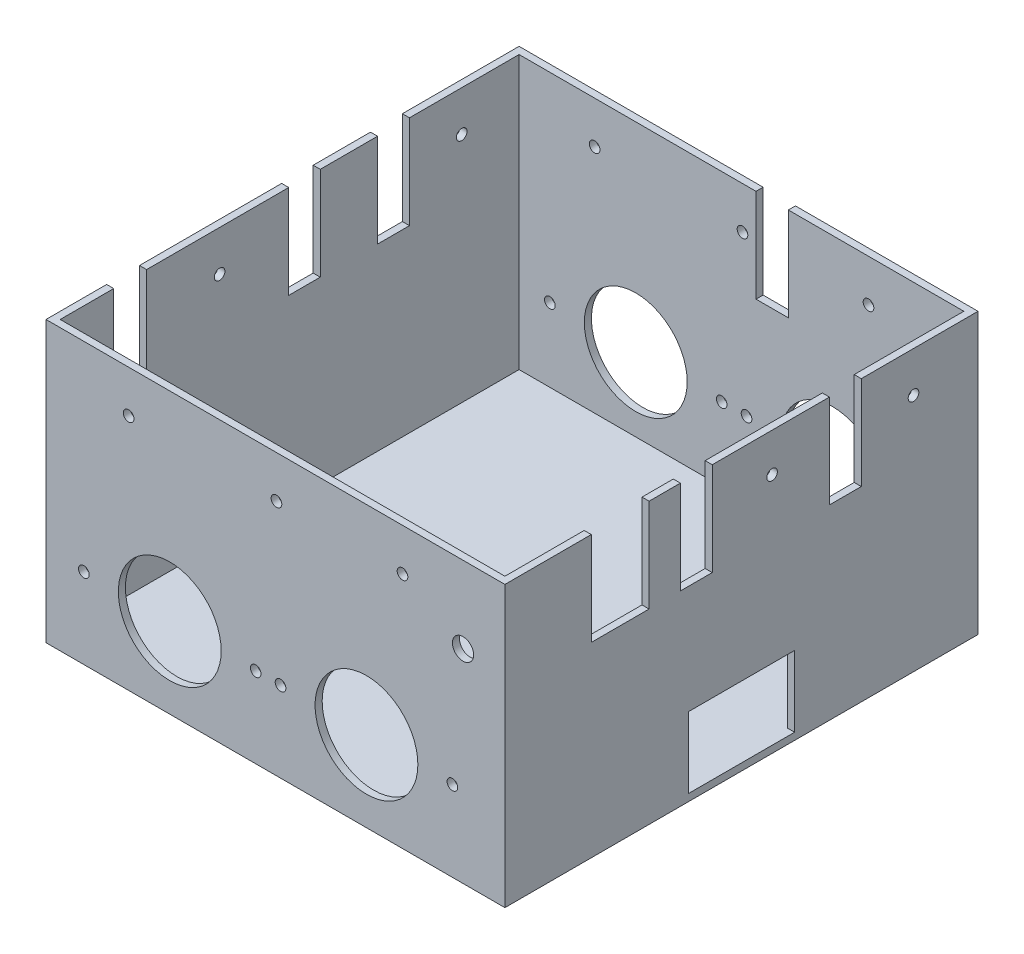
ISO-10303-21;
HEADER;
FILE_DESCRIPTION(('STEP AP214'),'2;1');
FILE_NAME('part.step','',(''),(''),'','','');
FILE_SCHEMA(('AUTOMOTIVE_DESIGN { 1 0 10303 214 1 1 1 1 }'));
ENDSEC;
DATA;
#1=APPLICATION_CONTEXT('core data for automotive mechanical design processes');
#2=APPLICATION_PROTOCOL_DEFINITION('international standard','automotive_design',2000,#1);
#3=PRODUCT_CONTEXT('',#1,'mechanical');
#4=PRODUCT('Part','Part','',(#3));
#5=PRODUCT_RELATED_PRODUCT_CATEGORY('part','',(#4));
#6=PRODUCT_DEFINITION_FORMATION('','',#4);
#7=PRODUCT_DEFINITION_CONTEXT('part definition',#1,'design');
#8=PRODUCT_DEFINITION('design','',#6,#7);
#9=PRODUCT_DEFINITION_SHAPE('','',#8);
#10=(LENGTH_UNIT() NAMED_UNIT(*) SI_UNIT(.MILLI.,.METRE.));
#11=(NAMED_UNIT(*) PLANE_ANGLE_UNIT() SI_UNIT($,.RADIAN.));
#12=(NAMED_UNIT(*) SI_UNIT($,.STERADIAN.) SOLID_ANGLE_UNIT());
#13=UNCERTAINTY_MEASURE_WITH_UNIT(LENGTH_MEASURE(1.E-05),#10,'distance_accuracy_value','');
#14=(GEOMETRIC_REPRESENTATION_CONTEXT(3) GLOBAL_UNCERTAINTY_ASSIGNED_CONTEXT((#13)) GLOBAL_UNIT_ASSIGNED_CONTEXT((#10,
#11,#12)) REPRESENTATION_CONTEXT('',''));
#15=CARTESIAN_POINT('',(0.,0.,0.));
#16=DIRECTION('',(0.,0.,1.));
#17=DIRECTION('',(1.,0.,0.));
#18=AXIS2_PLACEMENT_3D('',#15,#16,#17);
#19=CARTESIAN_POINT('',(126.5,92.,0.));
#20=DIRECTION('',(-1.,0.,0.));
#21=DIRECTION('',(0.,0.,1.));
#22=AXIS2_PLACEMENT_3D('',#19,#20,#21);
#23=PLANE('',#22);
#24=CARTESIAN_POINT('',(126.5,68.1168642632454,-74.3932276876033));
#25=DIRECTION('',(-1.,0.,0.));
#26=DIRECTION('',(0.,0.,1.));
#27=AXIS2_PLACEMENT_3D('',#24,#25,#26);
#28=CIRCLE('',#27,1.5);
#29=CARTESIAN_POINT('',(126.5,68.1168642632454,-72.8932276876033));
#30=VERTEX_POINT('',#29);
#31=EDGE_CURVE('E1034',#30,#30,#28,.T.);
#32=ORIENTED_EDGE('',*,*,#31,.F.);
#33=EDGE_LOOP('',(#32));
#34=FACE_BOUND('',#33,.T.);
#35=CARTESIAN_POINT('',(126.5,67.5528202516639,-114.30430198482));
#36=DIRECTION('',(-1.,0.,0.));
#37=DIRECTION('',(0.,0.,1.));
#38=AXIS2_PLACEMENT_3D('',#35,#36,#37);
#39=CIRCLE('',#38,1.5);
#40=CARTESIAN_POINT('',(126.5,67.5528202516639,-112.80430198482));
#41=VERTEX_POINT('',#40);
#42=EDGE_CURVE('E1029',#41,#41,#39,.T.);
#43=ORIENTED_EDGE('',*,*,#42,.F.);
#44=EDGE_LOOP('',(#43));
#45=FACE_BOUND('',#44,.T.);
#46=DIRECTION('',(0.,0.,1.));
#47=VECTOR('',#46,1.);
#48=CARTESIAN_POINT('',(126.5,22.,0.));
#49=LINE('',#48,#47);
#50=CARTESIAN_POINT('',(126.5,22.,-80.7500000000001));
#51=VERTEX_POINT('',#50);
#52=CARTESIAN_POINT('',(126.5,22.,-50.7500000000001));
#53=VERTEX_POINT('',#52);
#54=EDGE_CURVE('E315',#51,#53,#49,.T.);
#55=ORIENTED_EDGE('',*,*,#54,.T.);
#56=DIRECTION('',(0.,1.,0.));
#57=VECTOR('',#56,1.);
#58=CARTESIAN_POINT('',(126.5,0.,-50.7500000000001));
#59=LINE('',#58,#57);
#60=CARTESIAN_POINT('',(126.5,2.,-50.7500000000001));
#61=VERTEX_POINT('',#60);
#62=EDGE_CURVE('E308',#61,#53,#59,.T.);
#63=ORIENTED_EDGE('',*,*,#62,.F.);
#64=DIRECTION('',(0.,0.,-1.));
#65=VECTOR('',#64,1.);
#66=CARTESIAN_POINT('',(126.5,2.,0.));
#67=LINE('',#66,#65);
#68=CARTESIAN_POINT('',(126.5,2.,-1.00000000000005));
#69=VERTEX_POINT('',#68);
#70=EDGE_CURVE('E321',#69,#61,#67,.T.);
#71=ORIENTED_EDGE('',*,*,#70,.F.);
#72=DIRECTION('',(0.,-1.,0.));
#73=VECTOR('',#72,1.);
#74=CARTESIAN_POINT('',(126.5,92.,-1.00000000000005));
#75=LINE('',#74,#73);
#76=CARTESIAN_POINT('',(126.5,79.,-1.00000000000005));
#77=VERTEX_POINT('',#76);
#78=EDGE_CURVE('E353',#77,#69,#75,.T.);
#79=ORIENTED_EDGE('',*,*,#78,.F.);
#80=DIRECTION('',(0.,0.,1.));
#81=VECTOR('',#80,1.);
#82=CARTESIAN_POINT('',(126.5,79.,0.));
#83=LINE('',#82,#81);
#84=CARTESIAN_POINT('',(126.5,79.,-23.3771259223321));
#85=VERTEX_POINT('',#84);
#86=EDGE_CURVE('E598',#85,#77,#83,.T.);
#87=ORIENTED_EDGE('',*,*,#86,.F.);
#88=DIRECTION('',(0.,-1.,0.));
#89=VECTOR('',#88,1.);
#90=CARTESIAN_POINT('',(126.5,92.,-23.3771259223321));
#91=LINE('',#90,#89);
#92=CARTESIAN_POINT('',(126.5,52.641130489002,-23.3771259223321));
#93=VERTEX_POINT('',#92);
#94=EDGE_CURVE('E554',#85,#93,#91,.T.);
#95=ORIENTED_EDGE('',*,*,#94,.T.);
#96=DIRECTION('',(0.,0.,1.));
#97=VECTOR('',#96,1.);
#98=CARTESIAN_POINT('',(126.5,52.641130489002,0.));
#99=LINE('',#98,#97);
#100=CARTESIAN_POINT('',(126.5,52.641130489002,-39.6851080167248));
#101=VERTEX_POINT('',#100);
#102=EDGE_CURVE('E557',#101,#93,#99,.T.);
#103=ORIENTED_EDGE('',*,*,#102,.F.);
#104=DIRECTION('',(0.,-1.,0.));
#105=VECTOR('',#104,1.);
#106=CARTESIAN_POINT('',(126.5,92.,-39.6851080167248));
#107=LINE('',#106,#105);
#108=CARTESIAN_POINT('',(126.5,79.,-39.6851080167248));
#109=VERTEX_POINT('',#108);
#110=EDGE_CURVE('E512',#109,#101,#107,.T.);
#111=ORIENTED_EDGE('',*,*,#110,.F.);
#112=CARTESIAN_POINT('',(126.5,79.,-48.5095002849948));
#113=VERTEX_POINT('',#112);
#114=EDGE_CURVE('E669',#113,#109,#83,.T.);
#115=ORIENTED_EDGE('',*,*,#114,.F.);
#116=DIRECTION('',(0.,-1.,0.));
#117=VECTOR('',#116,1.);
#118=CARTESIAN_POINT('',(126.5,92.,-48.5095002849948));
#119=LINE('',#118,#117);
#120=CARTESIAN_POINT('',(126.5,52.641130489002,-48.5095002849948));
#121=VERTEX_POINT('',#120);
#122=EDGE_CURVE('E564',#113,#121,#119,.T.);
#123=ORIENTED_EDGE('',*,*,#122,.T.);
#124=DIRECTION('',(0.,0.,-1.));
#125=VECTOR('',#124,1.);
#126=CARTESIAN_POINT('',(126.5,52.641130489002,0.));
#127=LINE('',#126,#125);
#128=CARTESIAN_POINT('',(126.5,52.641130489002,-57.5095002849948));
#129=VERTEX_POINT('',#128);
#130=EDGE_CURVE('E559',#121,#129,#127,.T.);
#131=ORIENTED_EDGE('',*,*,#130,.T.);
#132=DIRECTION('',(0.,-1.,0.));
#133=VECTOR('',#132,1.);
#134=CARTESIAN_POINT('',(126.5,92.,-57.5095002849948));
#135=LINE('',#134,#133);
#136=CARTESIAN_POINT('',(126.5,79.,-57.5095002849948));
#137=VERTEX_POINT('',#136);
#138=EDGE_CURVE('E562',#137,#129,#135,.T.);
#139=ORIENTED_EDGE('',*,*,#138,.F.);
#140=CARTESIAN_POINT('',(126.5,79.,-90.5672089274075));
#141=VERTEX_POINT('',#140);
#142=EDGE_CURVE('E603',#141,#137,#83,.T.);
#143=ORIENTED_EDGE('',*,*,#142,.F.);
#144=DIRECTION('',(0.,-1.,0.));
#145=VECTOR('',#144,1.);
#146=CARTESIAN_POINT('',(126.5,92.,-90.5672089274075));
#147=LINE('',#146,#145);
#148=CARTESIAN_POINT('',(126.5,52.641130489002,-90.5672089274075));
#149=VERTEX_POINT('',#148);
#150=EDGE_CURVE('E572',#141,#149,#147,.T.);
#151=ORIENTED_EDGE('',*,*,#150,.T.);
#152=DIRECTION('',(0.,0.,-1.));
#153=VECTOR('',#152,1.);
#154=CARTESIAN_POINT('',(126.5,52.641130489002,0.));
#155=LINE('',#154,#153);
#156=CARTESIAN_POINT('',(126.5,52.641130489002,-99.5672089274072));
#157=VERTEX_POINT('',#156);
#158=EDGE_CURVE('E567',#149,#157,#155,.T.);
#159=ORIENTED_EDGE('',*,*,#158,.T.);
#160=DIRECTION('',(0.,-1.,0.));
#161=VECTOR('',#160,1.);
#162=CARTESIAN_POINT('',(126.5,92.,-99.5672089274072));
#163=LINE('',#162,#161);
#164=CARTESIAN_POINT('',(126.5,79.,-99.5672089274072));
#165=VERTEX_POINT('',#164);
#166=EDGE_CURVE('E570',#165,#157,#163,.T.);
#167=ORIENTED_EDGE('',*,*,#166,.F.);
#168=CARTESIAN_POINT('',(126.5,79.,-130.5));
#169=VERTEX_POINT('',#168);
#170=EDGE_CURVE('E599',#169,#165,#83,.T.);
#171=ORIENTED_EDGE('',*,*,#170,.F.);
#172=DIRECTION('',(0.,-1.,0.));
#173=VECTOR('',#172,1.);
#174=CARTESIAN_POINT('',(126.5,92.,-130.5));
#175=LINE('',#174,#173);
#176=CARTESIAN_POINT('',(126.5,2.,-130.5));
#177=VERTEX_POINT('',#176);
#178=EDGE_CURVE('E345',#169,#177,#175,.T.);
#179=ORIENTED_EDGE('',*,*,#178,.T.);
#180=CARTESIAN_POINT('',(126.5,2.,-80.7500000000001));
#181=VERTEX_POINT('',#180);
#182=EDGE_CURVE('E332',#181,#177,#67,.T.);
#183=ORIENTED_EDGE('',*,*,#182,.F.);
#184=DIRECTION('',(0.,1.,0.));
#185=VECTOR('',#184,1.);
#186=CARTESIAN_POINT('',(126.5,0.,-80.7500000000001));
#187=LINE('',#186,#185);
#188=EDGE_CURVE('E324',#181,#51,#187,.T.);
#189=ORIENTED_EDGE('',*,*,#188,.T.);
#190=EDGE_LOOP('',(#55,#63,#71,#79,#87,#95,#103,#111,#115,#123,#131,#139,#143,#151,#159,#167,
#171,#179,#183,#189));
#191=FACE_BOUND('',#190,.T.);
#192=ADVANCED_FACE('F43',(#34,#45,#191),#23,.T.);
#193=CARTESIAN_POINT('',(0.,2.,0.));
#194=DIRECTION('',(0.,-1.,0.));
#195=DIRECTION('',(0.,0.,-1.));
#196=AXIS2_PLACEMENT_3D('',#193,#194,#195);
#197=PLANE('',#196);
#198=DIRECTION('',(1.,0.,0.));
#199=VECTOR('',#198,1.);
#200=CARTESIAN_POINT('',(126.5,2.,-80.7500000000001));
#201=LINE('',#200,#199);
#202=CARTESIAN_POINT('',(128.5,2.,-80.7500000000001));
#203=VERTEX_POINT('',#202);
#204=EDGE_CURVE('E314',#181,#203,#201,.T.);
#205=ORIENTED_EDGE('',*,*,#204,.F.);
#206=ORIENTED_EDGE('',*,*,#182,.T.);
#207=DIRECTION('',(1.,0.,0.));
#208=VECTOR('',#207,1.);
#209=CARTESIAN_POINT('',(0.,2.,-130.5));
#210=LINE('',#209,#208);
#211=CARTESIAN_POINT('',(0.999999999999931,2.,-130.5));
#212=VERTEX_POINT('',#211);
#213=EDGE_CURVE('E342',#212,#177,#210,.T.);
#214=ORIENTED_EDGE('',*,*,#213,.F.);
#215=DIRECTION('',(0.,0.,-1.));
#216=VECTOR('',#215,1.);
#217=CARTESIAN_POINT('',(0.999999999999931,2.,0.));
#218=LINE('',#217,#216);
#219=CARTESIAN_POINT('',(0.999999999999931,2.,-1.00000000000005));
#220=VERTEX_POINT('',#219);
#221=EDGE_CURVE('E334',#220,#212,#218,.T.);
#222=ORIENTED_EDGE('',*,*,#221,.F.);
#223=DIRECTION('',(1.,0.,0.));
#224=VECTOR('',#223,1.);
#225=CARTESIAN_POINT('',(0.,2.,-1.00000000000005));
#226=LINE('',#225,#224);
#227=EDGE_CURVE('E330',#220,#69,#226,.T.);
#228=ORIENTED_EDGE('',*,*,#227,.T.);
#229=ORIENTED_EDGE('',*,*,#70,.T.);
#230=DIRECTION('',(1.,0.,0.));
#231=VECTOR('',#230,1.);
#232=CARTESIAN_POINT('',(126.5,2.,-50.7500000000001));
#233=LINE('',#232,#231);
#234=CARTESIAN_POINT('',(128.5,2.,-50.7500000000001));
#235=VERTEX_POINT('',#234);
#236=EDGE_CURVE('E305',#61,#235,#233,.T.);
#237=ORIENTED_EDGE('',*,*,#236,.T.);
#238=DIRECTION('',(0.,0.,1.));
#239=VECTOR('',#238,1.);
#240=CARTESIAN_POINT('',(128.5,1.99999999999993,0.));
#241=LINE('',#240,#239);
#242=EDGE_CURVE('E1019',#203,#235,#241,.T.);
#243=ORIENTED_EDGE('',*,*,#242,.F.);
#244=EDGE_LOOP('',(#205,#206,#214,#222,#228,#229,#237,#243));
#245=FACE_BOUND('',#244,.T.);
#246=ADVANCED_FACE('F327',(#245),#197,.F.);
#247=CARTESIAN_POINT('',(128.5,0.,0.));
#248=DIRECTION('',(1.,0.,0.));
#249=DIRECTION('',(0.,0.,-1.));
#250=AXIS2_PLACEMENT_3D('',#247,#248,#249);
#251=PLANE('',#250);
#252=DIRECTION('',(0.,1.,0.));
#253=VECTOR('',#252,1.);
#254=CARTESIAN_POINT('',(128.5,0.,-80.7500000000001));
#255=LINE('',#254,#253);
#256=CARTESIAN_POINT('',(128.5,22.,-80.7500000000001));
#257=VERTEX_POINT('',#256);
#258=EDGE_CURVE('E1012',#203,#257,#255,.T.);
#259=ORIENTED_EDGE('',*,*,#258,.F.);
#260=ORIENTED_EDGE('',*,*,#242,.T.);
#261=DIRECTION('',(0.,1.,0.));
#262=VECTOR('',#261,1.);
#263=CARTESIAN_POINT('',(128.5,0.,-50.7500000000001));
#264=LINE('',#263,#262);
#265=CARTESIAN_POINT('',(128.5,22.,-50.7500000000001));
#266=VERTEX_POINT('',#265);
#267=EDGE_CURVE('E311',#235,#266,#264,.T.);
#268=ORIENTED_EDGE('',*,*,#267,.T.);
#269=DIRECTION('',(0.,0.,1.));
#270=VECTOR('',#269,1.);
#271=CARTESIAN_POINT('',(128.5,22.,0.));
#272=LINE('',#271,#270);
#273=EDGE_CURVE('E325',#257,#266,#272,.T.);
#274=ORIENTED_EDGE('',*,*,#273,.F.);
#275=EDGE_LOOP('',(#259,#260,#268,#274));
#276=FACE_BOUND('',#275,.T.);
#277=CARTESIAN_POINT('',(128.5,68.1168642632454,-74.3932276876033));
#278=DIRECTION('',(1.,0.,0.));
#279=DIRECTION('',(0.,0.,-1.));
#280=AXIS2_PLACEMENT_3D('',#277,#278,#279);
#281=CIRCLE('',#280,1.5);
#282=CARTESIAN_POINT('',(128.5,68.1168642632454,-75.8932276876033));
#283=VERTEX_POINT('',#282);
#284=EDGE_CURVE('E1026',#283,#283,#281,.T.);
#285=ORIENTED_EDGE('',*,*,#284,.F.);
#286=EDGE_LOOP('',(#285));
#287=FACE_BOUND('',#286,.T.);
#288=CARTESIAN_POINT('',(128.5,67.5528202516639,-114.30430198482));
#289=DIRECTION('',(1.,0.,0.));
#290=DIRECTION('',(0.,0.,-1.));
#291=AXIS2_PLACEMENT_3D('',#288,#289,#290);
#292=CIRCLE('',#291,1.5);
#293=CARTESIAN_POINT('',(128.5,67.5528202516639,-115.80430198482));
#294=VERTEX_POINT('',#293);
#295=EDGE_CURVE('E1025',#294,#294,#292,.T.);
#296=ORIENTED_EDGE('',*,*,#295,.F.);
#297=EDGE_LOOP('',(#296));
#298=FACE_BOUND('',#297,.T.);
#299=DIRECTION('',(0.,0.,1.));
#300=VECTOR('',#299,1.);
#301=CARTESIAN_POINT('',(128.5,52.641130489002,0.));
#302=LINE('',#301,#300);
#303=CARTESIAN_POINT('',(128.5,52.641130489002,-99.5672089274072));
#304=VERTEX_POINT('',#303);
#305=CARTESIAN_POINT('',(128.5,52.641130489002,-90.5672089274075));
#306=VERTEX_POINT('',#305);
#307=EDGE_CURVE('E503',#304,#306,#302,.T.);
#308=ORIENTED_EDGE('',*,*,#307,.T.);
#309=DIRECTION('',(0.,1.,0.));
#310=VECTOR('',#309,1.);
#311=CARTESIAN_POINT('',(128.5,0.,-90.5672089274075));
#312=LINE('',#311,#310);
#313=CARTESIAN_POINT('',(128.5,79.,-90.5672089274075));
#314=VERTEX_POINT('',#313);
#315=EDGE_CURVE('E500',#306,#314,#312,.T.);
#316=ORIENTED_EDGE('',*,*,#315,.T.);
#317=DIRECTION('',(0.,0.,-1.));
#318=VECTOR('',#317,1.);
#319=CARTESIAN_POINT('',(128.5,79.,0.));
#320=LINE('',#319,#318);
#321=CARTESIAN_POINT('',(128.5,79.,-57.5095002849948));
#322=VERTEX_POINT('',#321);
#323=EDGE_CURVE('E643',#322,#314,#320,.T.);
#324=ORIENTED_EDGE('',*,*,#323,.F.);
#325=DIRECTION('',(0.,1.,0.));
#326=VECTOR('',#325,1.);
#327=CARTESIAN_POINT('',(128.5,0.,-57.5095002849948));
#328=LINE('',#327,#326);
#329=CARTESIAN_POINT('',(128.5,52.641130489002,-57.5095002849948));
#330=VERTEX_POINT('',#329);
#331=EDGE_CURVE('E527',#330,#322,#328,.T.);
#332=ORIENTED_EDGE('',*,*,#331,.F.);
#333=DIRECTION('',(0.,0.,1.));
#334=VECTOR('',#333,1.);
#335=CARTESIAN_POINT('',(128.5,52.641130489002,0.));
#336=LINE('',#335,#334);
#337=CARTESIAN_POINT('',(128.5,52.641130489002,-48.5095002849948));
#338=VERTEX_POINT('',#337);
#339=EDGE_CURVE('E523',#330,#338,#336,.T.);
#340=ORIENTED_EDGE('',*,*,#339,.T.);
#341=DIRECTION('',(0.,1.,0.));
#342=VECTOR('',#341,1.);
#343=CARTESIAN_POINT('',(128.5,0.,-48.5095002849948));
#344=LINE('',#343,#342);
#345=CARTESIAN_POINT('',(128.5,79.,-48.5095002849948));
#346=VERTEX_POINT('',#345);
#347=EDGE_CURVE('E520',#338,#346,#344,.T.);
#348=ORIENTED_EDGE('',*,*,#347,.T.);
#349=CARTESIAN_POINT('',(128.5,79.,-39.6851080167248));
#350=VERTEX_POINT('',#349);
#351=EDGE_CURVE('E52',#350,#346,#320,.T.);
#352=ORIENTED_EDGE('',*,*,#351,.F.);
#353=DIRECTION('',(0.,1.,0.));
#354=VECTOR('',#353,1.);
#355=CARTESIAN_POINT('',(128.5,0.,-39.6851080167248));
#356=LINE('',#355,#354);
#357=CARTESIAN_POINT('',(128.5,52.641130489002,-39.6851080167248));
#358=VERTEX_POINT('',#357);
#359=EDGE_CURVE('E539',#358,#350,#356,.T.);
#360=ORIENTED_EDGE('',*,*,#359,.F.);
#361=DIRECTION('',(0.,0.,-1.));
#362=VECTOR('',#361,1.);
#363=CARTESIAN_POINT('',(128.5,52.641130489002,0.));
#364=LINE('',#363,#362);
#365=CARTESIAN_POINT('',(128.5,52.641130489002,-23.3771259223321));
#366=VERTEX_POINT('',#365);
#367=EDGE_CURVE('E499',#366,#358,#364,.T.);
#368=ORIENTED_EDGE('',*,*,#367,.F.);
#369=DIRECTION('',(0.,1.,0.));
#370=VECTOR('',#369,1.);
#371=CARTESIAN_POINT('',(128.5,0.,-23.3771259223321));
#372=LINE('',#371,#370);
#373=CARTESIAN_POINT('',(128.5,79.,-23.3771259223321));
#374=VERTEX_POINT('',#373);
#375=EDGE_CURVE('E541',#366,#374,#372,.T.);
#376=ORIENTED_EDGE('',*,*,#375,.T.);
#377=CARTESIAN_POINT('',(128.5,79.,0.999999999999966));
#378=VERTEX_POINT('',#377);
#379=EDGE_CURVE('E11',#378,#374,#320,.T.);
#380=ORIENTED_EDGE('',*,*,#379,.F.);
#381=DIRECTION('',(0.,1.,0.));
#382=VECTOR('',#381,1.);
#383=CARTESIAN_POINT('',(128.5,0.,0.999999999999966));
#384=LINE('',#383,#382);
#385=CARTESIAN_POINT('',(128.5,0.,0.999999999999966));
#386=VERTEX_POINT('',#385);
#387=EDGE_CURVE('E338',#386,#378,#384,.T.);
#388=ORIENTED_EDGE('',*,*,#387,.F.);
#389=DIRECTION('',(0.,0.,-1.));
#390=VECTOR('',#389,1.);
#391=CARTESIAN_POINT('',(128.5,0.,0.));
#392=LINE('',#391,#390);
#393=CARTESIAN_POINT('',(128.5,0.,-132.5));
#394=VERTEX_POINT('',#393);
#395=EDGE_CURVE('E606',#386,#394,#392,.T.);
#396=ORIENTED_EDGE('',*,*,#395,.T.);
#397=DIRECTION('',(0.,1.,0.));
#398=VECTOR('',#397,1.);
#399=CARTESIAN_POINT('',(128.5,0.,-132.5));
#400=LINE('',#399,#398);
#401=CARTESIAN_POINT('',(128.5,79.,-132.5));
#402=VERTEX_POINT('',#401);
#403=EDGE_CURVE('E618',#394,#402,#400,.T.);
#404=ORIENTED_EDGE('',*,*,#403,.T.);
#405=CARTESIAN_POINT('',(128.5,79.,-99.5672089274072));
#406=VERTEX_POINT('',#405);
#407=EDGE_CURVE('E54',#406,#402,#320,.T.);
#408=ORIENTED_EDGE('',*,*,#407,.F.);
#409=DIRECTION('',(0.,1.,0.));
#410=VECTOR('',#409,1.);
#411=CARTESIAN_POINT('',(128.5,0.,-99.5672089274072));
#412=LINE('',#411,#410);
#413=EDGE_CURVE('E507',#304,#406,#412,.T.);
#414=ORIENTED_EDGE('',*,*,#413,.F.);
#415=EDGE_LOOP('',(#308,#316,#324,#332,#340,#348,#352,#360,#368,#376,#380,#388,#396,#404,#408,#414));
#416=FACE_BOUND('',#415,.T.);
#417=ADVANCED_FACE('F630',(#276,#287,#298,#416),#251,.T.);
#418=CARTESIAN_POINT('',(0.999999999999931,92.,0.));
#419=DIRECTION('',(-1.,0.,0.));
#420=DIRECTION('',(0.,0.,1.));
#421=AXIS2_PLACEMENT_3D('',#418,#419,#420);
#422=PLANE('',#421);
#423=CARTESIAN_POINT('',(0.999999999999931,67.5528202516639,-114.30430198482));
#424=DIRECTION('',(-1.,0.,0.));
#425=DIRECTION('',(0.,0.,1.));
#426=AXIS2_PLACEMENT_3D('',#423,#424,#425);
#427=CIRCLE('',#426,1.5);
#428=CARTESIAN_POINT('',(0.999999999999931,67.5528202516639,-112.80430198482));
#429=VERTEX_POINT('',#428);
#430=EDGE_CURVE('E385',#429,#429,#427,.T.);
#431=ORIENTED_EDGE('',*,*,#430,.T.);
#432=EDGE_LOOP('',(#431));
#433=FACE_BOUND('',#432,.T.);
#434=CARTESIAN_POINT('',(0.999999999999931,67.5528202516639,-45.9909562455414));
#435=DIRECTION('',(-1.,0.,0.));
#436=DIRECTION('',(0.,0.,1.));
#437=AXIS2_PLACEMENT_3D('',#434,#435,#436);
#438=CIRCLE('',#437,1.5);
#439=CARTESIAN_POINT('',(0.999999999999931,67.5528202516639,-44.4909562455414));
#440=VERTEX_POINT('',#439);
#441=EDGE_CURVE('E390',#440,#440,#438,.T.);
#442=ORIENTED_EDGE('',*,*,#441,.T.);
#443=EDGE_LOOP('',(#442));
#444=FACE_BOUND('',#443,.T.);
#445=ORIENTED_EDGE('',*,*,#221,.T.);
#446=DIRECTION('',(0.,-1.,0.));
#447=VECTOR('',#446,1.);
#448=CARTESIAN_POINT('',(0.999999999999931,92.,-130.5));
#449=LINE('',#448,#447);
#450=CARTESIAN_POINT('',(0.999999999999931,79.,-130.5));
#451=VERTEX_POINT('',#450);
#452=EDGE_CURVE('E348',#451,#212,#449,.T.);
#453=ORIENTED_EDGE('',*,*,#452,.F.);
#454=DIRECTION('',(0.,0.,1.));
#455=VECTOR('',#454,1.);
#456=CARTESIAN_POINT('',(0.999999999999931,79.,0.));
#457=LINE('',#456,#455);
#458=CARTESIAN_POINT('',(0.999999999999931,79.,-99.5672089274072));
#459=VERTEX_POINT('',#458);
#460=EDGE_CURVE('E591',#451,#459,#457,.T.);
#461=ORIENTED_EDGE('',*,*,#460,.T.);
#462=DIRECTION('',(0.,-1.,0.));
#463=VECTOR('',#462,1.);
#464=CARTESIAN_POINT('',(0.999999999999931,92.,-99.5672089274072));
#465=LINE('',#464,#463);
#466=CARTESIAN_POINT('',(0.999999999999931,52.641130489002,-99.5672089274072));
#467=VERTEX_POINT('',#466);
#468=EDGE_CURVE('E496',#459,#467,#465,.T.);
#469=ORIENTED_EDGE('',*,*,#468,.T.);
#470=DIRECTION('',(0.,0.,1.));
#471=VECTOR('',#470,1.);
#472=CARTESIAN_POINT('',(0.999999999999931,52.641130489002,0.));
#473=LINE('',#472,#471);
#474=CARTESIAN_POINT('',(0.999999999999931,52.641130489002,-90.5672089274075));
#475=VERTEX_POINT('',#474);
#476=EDGE_CURVE('E490',#467,#475,#473,.T.);
#477=ORIENTED_EDGE('',*,*,#476,.T.);
#478=DIRECTION('',(0.,1.,0.));
#479=VECTOR('',#478,1.);
#480=CARTESIAN_POINT('',(0.999999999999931,92.,-90.5672089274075));
#481=LINE('',#480,#479);
#482=CARTESIAN_POINT('',(0.999999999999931,79.,-90.5672089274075));
#483=VERTEX_POINT('',#482);
#484=EDGE_CURVE('E493',#475,#483,#481,.T.);
#485=ORIENTED_EDGE('',*,*,#484,.T.);
#486=CARTESIAN_POINT('',(0.999999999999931,79.,-74.3932276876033));
#487=VERTEX_POINT('',#486);
#488=EDGE_CURVE('E595',#483,#487,#457,.T.);
#489=ORIENTED_EDGE('',*,*,#488,.T.);
#490=DIRECTION('',(0.,-1.,0.));
#491=VECTOR('',#490,1.);
#492=CARTESIAN_POINT('',(0.999999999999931,92.,-74.3932276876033));
#493=LINE('',#492,#491);
#494=CARTESIAN_POINT('',(0.999999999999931,52.641130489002,-74.3932276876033));
#495=VERTEX_POINT('',#494);
#496=EDGE_CURVE('E434',#487,#495,#493,.T.);
#497=ORIENTED_EDGE('',*,*,#496,.T.);
#498=DIRECTION('',(0.,0.,1.));
#499=VECTOR('',#498,1.);
#500=CARTESIAN_POINT('',(0.999999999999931,52.6411304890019,0.));
#501=LINE('',#500,#499);
#502=CARTESIAN_POINT('',(0.999999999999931,52.641130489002,-65.5000000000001));
#503=VERTEX_POINT('',#502);
#504=EDGE_CURVE('E475',#495,#503,#501,.T.);
#505=ORIENTED_EDGE('',*,*,#504,.T.);
#506=DIRECTION('',(0.,1.,0.));
#507=VECTOR('',#506,1.);
#508=CARTESIAN_POINT('',(0.999999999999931,92.,-65.5));
#509=LINE('',#508,#507);
#510=CARTESIAN_POINT('',(0.999999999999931,79.,-65.5));
#511=VERTEX_POINT('',#510);
#512=EDGE_CURVE('E478',#503,#511,#509,.T.);
#513=ORIENTED_EDGE('',*,*,#512,.T.);
#514=CARTESIAN_POINT('',(0.999999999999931,79.,-25.3865142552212));
#515=VERTEX_POINT('',#514);
#516=EDGE_CURVE('E724',#511,#515,#457,.T.);
#517=ORIENTED_EDGE('',*,*,#516,.T.);
#518=DIRECTION('',(0.,-1.,0.));
#519=VECTOR('',#518,1.);
#520=CARTESIAN_POINT('',(0.999999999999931,92.,-25.3865142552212));
#521=LINE('',#520,#519);
#522=CARTESIAN_POINT('',(0.999999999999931,52.641130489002,-25.3865142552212));
#523=VERTEX_POINT('',#522);
#524=EDGE_CURVE('E481',#515,#523,#521,.T.);
#525=ORIENTED_EDGE('',*,*,#524,.T.);
#526=DIRECTION('',(0.,0.,1.));
#527=VECTOR('',#526,1.);
#528=CARTESIAN_POINT('',(0.999999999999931,52.641130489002,0.));
#529=LINE('',#528,#527);
#530=CARTESIAN_POINT('',(0.999999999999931,52.641130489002,-16.114547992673));
#531=VERTEX_POINT('',#530);
#532=EDGE_CURVE('E484',#523,#531,#529,.T.);
#533=ORIENTED_EDGE('',*,*,#532,.T.);
#534=DIRECTION('',(0.,1.,0.));
#535=VECTOR('',#534,1.);
#536=CARTESIAN_POINT('',(0.999999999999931,92.,-16.114547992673));
#537=LINE('',#536,#535);
#538=CARTESIAN_POINT('',(0.999999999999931,79.,-16.114547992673));
#539=VERTEX_POINT('',#538);
#540=EDGE_CURVE('E487',#531,#539,#537,.T.);
#541=ORIENTED_EDGE('',*,*,#540,.T.);
#542=CARTESIAN_POINT('',(0.999999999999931,79.,-1.00000000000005));
#543=VERTEX_POINT('',#542);
#544=EDGE_CURVE('E590',#539,#543,#457,.T.);
#545=ORIENTED_EDGE('',*,*,#544,.T.);
#546=DIRECTION('',(0.,-1.,0.));
#547=VECTOR('',#546,1.);
#548=CARTESIAN_POINT('',(0.999999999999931,92.,-1.00000000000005));
#549=LINE('',#548,#547);
#550=EDGE_CURVE('E351',#543,#220,#549,.T.);
#551=ORIENTED_EDGE('',*,*,#550,.T.);
#552=EDGE_LOOP('',(#445,#453,#461,#469,#477,#485,#489,#497,#505,#513,#517,#525,#533,#541,#545,#551));
#553=FACE_BOUND('',#552,.T.);
#554=ADVANCED_FACE('F682',(#433,#444,#553),#422,.F.);
#555=CARTESIAN_POINT('',(-1.00000000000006,0.,0.));
#556=DIRECTION('',(1.,0.,0.));
#557=DIRECTION('',(0.,0.,-1.));
#558=AXIS2_PLACEMENT_3D('',#555,#556,#557);
#559=PLANE('',#558);
#560=DIRECTION('',(0.,0.,1.));
#561=VECTOR('',#560,1.);
#562=CARTESIAN_POINT('',(-1.00000000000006,52.641130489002,-99.5672089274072));
#563=LINE('',#562,#561);
#564=CARTESIAN_POINT('',(-1.00000000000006,52.641130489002,-99.5672089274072));
#565=VERTEX_POINT('',#564);
#566=CARTESIAN_POINT('',(-1.00000000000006,52.641130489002,-90.5672089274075));
#567=VERTEX_POINT('',#566);
#568=EDGE_CURVE('E425',#565,#567,#563,.T.);
#569=ORIENTED_EDGE('',*,*,#568,.F.);
#570=DIRECTION('',(0.,-1.,0.));
#571=VECTOR('',#570,1.);
#572=CARTESIAN_POINT('',(-1.00000000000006,79.,-99.5672089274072));
#573=LINE('',#572,#571);
#574=CARTESIAN_POINT('',(-1.00000000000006,79.,-99.5672089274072));
#575=VERTEX_POINT('',#574);
#576=EDGE_CURVE('E69',#575,#565,#573,.T.);
#577=ORIENTED_EDGE('',*,*,#576,.F.);
#578=DIRECTION('',(0.,0.,1.));
#579=VECTOR('',#578,1.);
#580=CARTESIAN_POINT('',(-1.00000000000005,79.,-150.));
#581=LINE('',#580,#579);
#582=CARTESIAN_POINT('',(-1.00000000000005,79.,-132.5));
#583=VERTEX_POINT('',#582);
#584=EDGE_CURVE('E578',#583,#575,#581,.T.);
#585=ORIENTED_EDGE('',*,*,#584,.F.);
#586=DIRECTION('',(0.,1.,0.));
#587=VECTOR('',#586,1.);
#588=CARTESIAN_POINT('',(-1.00000000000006,0.,-132.5));
#589=LINE('',#588,#587);
#590=CARTESIAN_POINT('',(-1.00000000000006,0.,-132.5));
#591=VERTEX_POINT('',#590);
#592=EDGE_CURVE('E616',#591,#583,#589,.T.);
#593=ORIENTED_EDGE('',*,*,#592,.F.);
#594=DIRECTION('',(0.,0.,-1.));
#595=VECTOR('',#594,1.);
#596=CARTESIAN_POINT('',(-1.00000000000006,0.,0.));
#597=LINE('',#596,#595);
#598=CARTESIAN_POINT('',(-1.00000000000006,0.,0.999999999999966));
#599=VERTEX_POINT('',#598);
#600=EDGE_CURVE('E611',#599,#591,#597,.T.);
#601=ORIENTED_EDGE('',*,*,#600,.F.);
#602=DIRECTION('',(0.,1.,0.));
#603=VECTOR('',#602,1.);
#604=CARTESIAN_POINT('',(-1.00000000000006,0.,0.999999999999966));
#605=LINE('',#604,#603);
#606=CARTESIAN_POINT('',(-1.00000000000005,79.,0.999999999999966));
#607=VERTEX_POINT('',#606);
#608=EDGE_CURVE('E336',#599,#607,#605,.T.);
#609=ORIENTED_EDGE('',*,*,#608,.T.);
#610=CARTESIAN_POINT('',(-1.00000000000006,79.,-16.114547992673));
#611=VERTEX_POINT('',#610);
#612=EDGE_CURVE('E577',#611,#607,#581,.T.);
#613=ORIENTED_EDGE('',*,*,#612,.F.);
#614=DIRECTION('',(0.,1.,0.));
#615=VECTOR('',#614,1.);
#616=CARTESIAN_POINT('',(-1.00000000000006,52.641130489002,-16.114547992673));
#617=LINE('',#616,#615);
#618=CARTESIAN_POINT('',(-1.00000000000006,52.641130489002,-16.114547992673));
#619=VERTEX_POINT('',#618);
#620=EDGE_CURVE('E426',#619,#611,#617,.T.);
#621=ORIENTED_EDGE('',*,*,#620,.F.);
#622=DIRECTION('',(0.,0.,1.));
#623=VECTOR('',#622,1.);
#624=CARTESIAN_POINT('',(-1.00000000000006,52.641130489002,-16.114547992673));
#625=LINE('',#624,#623);
#626=CARTESIAN_POINT('',(-1.00000000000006,52.641130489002,-25.3865142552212));
#627=VERTEX_POINT('',#626);
#628=EDGE_CURVE('E444',#627,#619,#625,.T.);
#629=ORIENTED_EDGE('',*,*,#628,.F.);
#630=DIRECTION('',(0.,-1.,0.));
#631=VECTOR('',#630,1.);
#632=CARTESIAN_POINT('',(-1.00000000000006,52.641130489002,-25.3865142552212));
#633=LINE('',#632,#631);
#634=CARTESIAN_POINT('',(-1.00000000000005,79.,-25.3865142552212));
#635=VERTEX_POINT('',#634);
#636=EDGE_CURVE('E454',#635,#627,#633,.T.);
#637=ORIENTED_EDGE('',*,*,#636,.F.);
#638=CARTESIAN_POINT('',(-1.00000000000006,79.,-65.5));
#639=VERTEX_POINT('',#638);
#640=EDGE_CURVE('E732',#639,#635,#581,.T.);
#641=ORIENTED_EDGE('',*,*,#640,.F.);
#642=DIRECTION('',(0.,1.,0.));
#643=VECTOR('',#642,1.);
#644=CARTESIAN_POINT('',(-1.00000000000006,52.641130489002,-65.5000000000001));
#645=LINE('',#644,#643);
#646=CARTESIAN_POINT('',(-1.00000000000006,52.641130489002,-65.5000000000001));
#647=VERTEX_POINT('',#646);
#648=EDGE_CURVE('E451',#647,#639,#645,.T.);
#649=ORIENTED_EDGE('',*,*,#648,.F.);
#650=DIRECTION('',(0.,0.,1.));
#651=VECTOR('',#650,1.);
#652=CARTESIAN_POINT('',(-1.00000000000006,52.641130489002,-65.5000000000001));
#653=LINE('',#652,#651);
#654=CARTESIAN_POINT('',(-1.00000000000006,52.641130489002,-74.3932276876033));
#655=VERTEX_POINT('',#654);
#656=EDGE_CURVE('E461',#655,#647,#653,.T.);
#657=ORIENTED_EDGE('',*,*,#656,.F.);
#658=DIRECTION('',(0.,-1.,0.));
#659=VECTOR('',#658,1.);
#660=CARTESIAN_POINT('',(-1.00000000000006,52.641130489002,-74.3932276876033));
#661=LINE('',#660,#659);
#662=CARTESIAN_POINT('',(-1.00000000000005,79.,-74.3932276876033));
#663=VERTEX_POINT('',#662);
#664=EDGE_CURVE('E469',#663,#655,#661,.T.);
#665=ORIENTED_EDGE('',*,*,#664,.F.);
#666=CARTESIAN_POINT('',(-1.00000000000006,79.,-90.5672089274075));
#667=VERTEX_POINT('',#666);
#668=EDGE_CURVE('E582',#667,#663,#581,.T.);
#669=ORIENTED_EDGE('',*,*,#668,.F.);
#670=DIRECTION('',(0.,1.,0.));
#671=VECTOR('',#670,1.);
#672=CARTESIAN_POINT('',(-1.00000000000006,79.,-90.5672089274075));
#673=LINE('',#672,#671);
#674=EDGE_CURVE('E429',#567,#667,#673,.T.);
#675=ORIENTED_EDGE('',*,*,#674,.F.);
#676=EDGE_LOOP('',(#569,#577,#585,#593,#601,#609,#613,#621,#629,#637,#641,#649,#657,#665,#669,#675));
#677=FACE_BOUND('',#676,.T.);
#678=CARTESIAN_POINT('',(-1.00000000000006,67.5528202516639,-114.30430198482));
#679=DIRECTION('',(-1.,0.,0.));
#680=DIRECTION('',(0.,0.,1.));
#681=AXIS2_PLACEMENT_3D('',#678,#679,#680);
#682=CIRCLE('',#681,1.5);
#683=CARTESIAN_POINT('',(-1.00000000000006,67.5528202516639,-112.80430198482));
#684=VERTEX_POINT('',#683);
#685=EDGE_CURVE('E381',#684,#684,#682,.T.);
#686=ORIENTED_EDGE('',*,*,#685,.F.);
#687=EDGE_LOOP('',(#686));
#688=FACE_BOUND('',#687,.T.);
#689=CARTESIAN_POINT('',(-1.00000000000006,67.5528202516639,-45.9909562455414));
#690=DIRECTION('',(-1.,0.,0.));
#691=DIRECTION('',(0.,0.,1.));
#692=AXIS2_PLACEMENT_3D('',#689,#690,#691);
#693=CIRCLE('',#692,1.5);
#694=CARTESIAN_POINT('',(-1.00000000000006,67.5528202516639,-44.4909562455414));
#695=VERTEX_POINT('',#694);
#696=EDGE_CURVE('E382',#695,#695,#693,.T.);
#697=ORIENTED_EDGE('',*,*,#696,.F.);
#698=EDGE_LOOP('',(#697));
#699=FACE_BOUND('',#698,.T.);
#700=ADVANCED_FACE('F711',(#677,#688,#699),#559,.F.);
#701=CARTESIAN_POINT('',(0.,92.,-130.5));
#702=DIRECTION('',(0.,0.,-1.));
#703=DIRECTION('',(-1.,0.,0.));
#704=AXIS2_PLACEMENT_3D('',#701,#702,#703);
#705=PLANE('',#704);
#706=CARTESIAN_POINT('',(113.683106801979,22.6953278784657,-130.5));
#707=DIRECTION('',(0.,0.,-1.));
#708=DIRECTION('',(-1.,0.,0.));
#709=AXIS2_PLACEMENT_3D('',#706,#707,#708);
#710=CIRCLE('',#709,1.5);
#711=CARTESIAN_POINT('',(112.183106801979,22.6953278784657,-130.5));
#712=VERTEX_POINT('',#711);
#713=EDGE_CURVE('E1006',#712,#712,#710,.T.);
#714=ORIENTED_EDGE('',*,*,#713,.T.);
#715=EDGE_LOOP('',(#714));
#716=FACE_BOUND('',#715,.T.);
#717=CARTESIAN_POINT('',(65.1831068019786,22.6953278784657,-130.5));
#718=DIRECTION('',(0.,0.,-1.));
#719=DIRECTION('',(-1.,0.,0.));
#720=AXIS2_PLACEMENT_3D('',#717,#718,#719);
#721=CIRCLE('',#720,1.50000000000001);
#722=CARTESIAN_POINT('',(63.6831068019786,22.6953278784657,-130.5));
#723=VERTEX_POINT('',#722);
#724=EDGE_CURVE('E997',#723,#723,#721,.T.);
#725=ORIENTED_EDGE('',*,*,#724,.T.);
#726=EDGE_LOOP('',(#725));
#727=FACE_BOUND('',#726,.T.);
#728=CARTESIAN_POINT('',(89.4331068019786,22.6953278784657,-130.5));
#729=DIRECTION('',(0.,0.,-1.));
#730=DIRECTION('',(-1.,0.,0.));
#731=AXIS2_PLACEMENT_3D('',#728,#729,#730);
#732=CIRCLE('',#731,14.5);
#733=CARTESIAN_POINT('',(74.9331068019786,22.6953278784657,-130.5));
#734=VERTEX_POINT('',#733);
#735=EDGE_CURVE('E988',#734,#734,#732,.T.);
#736=ORIENTED_EDGE('',*,*,#735,.T.);
#737=EDGE_LOOP('',(#736));
#738=FACE_BOUND('',#737,.T.);
#739=CARTESIAN_POINT('',(9.67726636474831,22.6953278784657,-130.5));
#740=DIRECTION('',(0.,0.,-1.));
#741=DIRECTION('',(-1.,0.,0.));
#742=AXIS2_PLACEMENT_3D('',#739,#740,#741);
#743=CIRCLE('',#742,1.5);
#744=CARTESIAN_POINT('',(8.17726636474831,22.6953278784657,-130.5));
#745=VERTEX_POINT('',#744);
#746=EDGE_CURVE('E979',#745,#745,#743,.T.);
#747=ORIENTED_EDGE('',*,*,#746,.T.);
#748=EDGE_LOOP('',(#747));
#749=FACE_BOUND('',#748,.T.);
#750=CARTESIAN_POINT('',(58.1772663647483,22.6953278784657,-130.5));
#751=DIRECTION('',(0.,0.,-1.));
#752=DIRECTION('',(-1.,0.,0.));
#753=AXIS2_PLACEMENT_3D('',#750,#751,#752);
#754=CIRCLE('',#753,1.5);
#755=CARTESIAN_POINT('',(56.6772663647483,22.6953278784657,-130.5));
#756=VERTEX_POINT('',#755);
#757=EDGE_CURVE('E970',#756,#756,#754,.T.);
#758=ORIENTED_EDGE('',*,*,#757,.T.);
#759=EDGE_LOOP('',(#758));
#760=FACE_BOUND('',#759,.T.);
#761=CARTESIAN_POINT('',(33.9239760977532,22.7050233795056,-130.5));
#762=DIRECTION('',(0.,0.,-1.));
#763=DIRECTION('',(-1.,0.,0.));
#764=AXIS2_PLACEMENT_3D('',#761,#762,#763);
#765=CIRCLE('',#764,14.5102385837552);
#766=CARTESIAN_POINT('',(19.413737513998,22.7050233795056,-130.5));
#767=VERTEX_POINT('',#766);
#768=EDGE_CURVE('E961',#767,#767,#765,.T.);
#769=ORIENTED_EDGE('',*,*,#768,.T.);
#770=EDGE_LOOP('',(#769));
#771=FACE_BOUND('',#770,.T.);
#772=ORIENTED_EDGE('',*,*,#213,.T.);
#773=ORIENTED_EDGE('',*,*,#178,.F.);
#774=DIRECTION('',(-1.,0.,0.));
#775=VECTOR('',#774,1.);
#776=CARTESIAN_POINT('',(0.,79.,-130.5));
#777=LINE('',#776,#775);
#778=CARTESIAN_POINT('',(76.9819318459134,79.,-130.5));
#779=VERTEX_POINT('',#778);
#780=EDGE_CURVE('E587',#169,#779,#777,.T.);
#781=ORIENTED_EDGE('',*,*,#780,.T.);
#782=DIRECTION('',(0.,-1.,0.));
#783=VECTOR('',#782,1.);
#784=CARTESIAN_POINT('',(76.9819318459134,92.,-130.5));
#785=LINE('',#784,#783);
#786=CARTESIAN_POINT('',(76.9819318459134,52.641130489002,-130.5));
#787=VERTEX_POINT('',#786);
#788=EDGE_CURVE('E410',#779,#787,#785,.T.);
#789=ORIENTED_EDGE('',*,*,#788,.T.);
#790=DIRECTION('',(-1.,0.,0.));
#791=VECTOR('',#790,1.);
#792=CARTESIAN_POINT('',(0.,52.641130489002,-130.5));
#793=LINE('',#792,#791);
#794=CARTESIAN_POINT('',(67.8644541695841,52.641130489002,-130.5));
#795=VERTEX_POINT('',#794);
#796=EDGE_CURVE('E418',#787,#795,#793,.T.);
#797=ORIENTED_EDGE('',*,*,#796,.T.);
#798=DIRECTION('',(0.,-1.,0.));
#799=VECTOR('',#798,1.);
#800=CARTESIAN_POINT('',(67.8644541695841,92.,-130.5));
#801=LINE('',#800,#799);
#802=CARTESIAN_POINT('',(67.8644541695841,79.,-130.5));
#803=VERTEX_POINT('',#802);
#804=EDGE_CURVE('E421',#803,#795,#801,.T.);
#805=ORIENTED_EDGE('',*,*,#804,.F.);
#806=EDGE_CURVE('E586',#803,#451,#777,.T.);
#807=ORIENTED_EDGE('',*,*,#806,.T.);
#808=ORIENTED_EDGE('',*,*,#452,.T.);
#809=EDGE_LOOP('',(#772,#773,#781,#789,#797,#805,#807,#808));
#810=FACE_BOUND('',#809,.T.);
#811=CARTESIAN_POINT('',(64.0391712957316,67.0992519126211,-130.5));
#812=DIRECTION('',(0.,0.,-1.));
#813=DIRECTION('',(-1.,0.,0.));
#814=AXIS2_PLACEMENT_3D('',#811,#812,#813);
#815=CIRCLE('',#814,1.50000000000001);
#816=CARTESIAN_POINT('',(62.5391712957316,67.0992519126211,-130.5));
#817=VERTEX_POINT('',#816);
#818=EDGE_CURVE('E357',#817,#817,#815,.T.);
#819=ORIENTED_EDGE('',*,*,#818,.T.);
#820=EDGE_LOOP('',(#819));
#821=FACE_BOUND('',#820,.T.);
#822=CARTESIAN_POINT('',(99.5984501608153,67.0992519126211,-130.5));
#823=DIRECTION('',(0.,0.,-1.));
#824=DIRECTION('',(-1.,0.,0.));
#825=AXIS2_PLACEMENT_3D('',#822,#823,#824);
#826=CIRCLE('',#825,1.5);
#827=CARTESIAN_POINT('',(98.0984501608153,67.0992519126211,-130.5));
#828=VERTEX_POINT('',#827);
#829=EDGE_CURVE('E361',#828,#828,#826,.T.);
#830=ORIENTED_EDGE('',*,*,#829,.T.);
#831=EDGE_LOOP('',(#830));
#832=FACE_BOUND('',#831,.T.);
#833=CARTESIAN_POINT('',(22.3208101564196,67.0992519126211,-130.5));
#834=DIRECTION('',(0.,0.,-1.));
#835=DIRECTION('',(-1.,0.,0.));
#836=AXIS2_PLACEMENT_3D('',#833,#834,#835);
#837=CIRCLE('',#836,1.5);
#838=CARTESIAN_POINT('',(20.8208101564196,67.0992519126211,-130.5));
#839=VERTEX_POINT('',#838);
#840=EDGE_CURVE('E378',#839,#839,#837,.T.);
#841=ORIENTED_EDGE('',*,*,#840,.T.);
#842=EDGE_LOOP('',(#841));
#843=FACE_BOUND('',#842,.T.);
#844=ADVANCED_FACE('F688',(#716,#727,#738,#749,#760,#771,#810,#821,#832,#843),#705,.F.);
#845=CARTESIAN_POINT('',(0.,0.,-132.5));
#846=DIRECTION('',(0.,0.,1.));
#847=DIRECTION('',(1.,0.,0.));
#848=AXIS2_PLACEMENT_3D('',#845,#846,#847);
#849=PLANE('',#848);
#850=CARTESIAN_POINT('',(113.683106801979,22.6953278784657,-132.5));
#851=DIRECTION('',(0.,0.,1.));
#852=DIRECTION('',(1.,0.,0.));
#853=AXIS2_PLACEMENT_3D('',#850,#851,#852);
#854=CIRCLE('',#853,1.5);
#855=CARTESIAN_POINT('',(115.183106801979,22.6953278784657,-132.5));
#856=VERTEX_POINT('',#855);
#857=EDGE_CURVE('E1003',#856,#856,#854,.T.);
#858=ORIENTED_EDGE('',*,*,#857,.T.);
#859=EDGE_LOOP('',(#858));
#860=FACE_BOUND('',#859,.T.);
#861=CARTESIAN_POINT('',(65.1831068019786,22.6953278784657,-132.5));
#862=DIRECTION('',(0.,0.,1.));
#863=DIRECTION('',(1.,0.,0.));
#864=AXIS2_PLACEMENT_3D('',#861,#862,#863);
#865=CIRCLE('',#864,1.50000000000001);
#866=CARTESIAN_POINT('',(66.6831068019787,22.6953278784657,-132.5));
#867=VERTEX_POINT('',#866);
#868=EDGE_CURVE('E994',#867,#867,#865,.T.);
#869=ORIENTED_EDGE('',*,*,#868,.T.);
#870=EDGE_LOOP('',(#869));
#871=FACE_BOUND('',#870,.T.);
#872=CARTESIAN_POINT('',(89.4331068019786,22.6953278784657,-132.5));
#873=DIRECTION('',(0.,0.,1.));
#874=DIRECTION('',(1.,0.,0.));
#875=AXIS2_PLACEMENT_3D('',#872,#873,#874);
#876=CIRCLE('',#875,14.5);
#877=CARTESIAN_POINT('',(103.933106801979,22.6953278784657,-132.5));
#878=VERTEX_POINT('',#877);
#879=EDGE_CURVE('E985',#878,#878,#876,.T.);
#880=ORIENTED_EDGE('',*,*,#879,.T.);
#881=EDGE_LOOP('',(#880));
#882=FACE_BOUND('',#881,.T.);
#883=CARTESIAN_POINT('',(9.67726636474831,22.6953278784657,-132.5));
#884=DIRECTION('',(0.,0.,1.));
#885=DIRECTION('',(1.,0.,0.));
#886=AXIS2_PLACEMENT_3D('',#883,#884,#885);
#887=CIRCLE('',#886,1.5);
#888=CARTESIAN_POINT('',(11.1772663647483,22.6953278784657,-132.5));
#889=VERTEX_POINT('',#888);
#890=EDGE_CURVE('E976',#889,#889,#887,.T.);
#891=ORIENTED_EDGE('',*,*,#890,.T.);
#892=EDGE_LOOP('',(#891));
#893=FACE_BOUND('',#892,.T.);
#894=CARTESIAN_POINT('',(58.1772663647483,22.6953278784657,-132.5));
#895=DIRECTION('',(0.,0.,1.));
#896=DIRECTION('',(1.,0.,0.));
#897=AXIS2_PLACEMENT_3D('',#894,#895,#896);
#898=CIRCLE('',#897,1.5);
#899=CARTESIAN_POINT('',(59.6772663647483,22.6953278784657,-132.5));
#900=VERTEX_POINT('',#899);
#901=EDGE_CURVE('E967',#900,#900,#898,.T.);
#902=ORIENTED_EDGE('',*,*,#901,.T.);
#903=EDGE_LOOP('',(#902));
#904=FACE_BOUND('',#903,.T.);
#905=CARTESIAN_POINT('',(33.9239760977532,22.7050233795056,-132.5));
#906=DIRECTION('',(0.,0.,1.));
#907=DIRECTION('',(1.,0.,0.));
#908=AXIS2_PLACEMENT_3D('',#905,#906,#907);
#909=CIRCLE('',#908,14.5102385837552);
#910=CARTESIAN_POINT('',(48.4342146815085,22.7050233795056,-132.5));
#911=VERTEX_POINT('',#910);
#912=EDGE_CURVE('E958',#911,#911,#909,.T.);
#913=ORIENTED_EDGE('',*,*,#912,.T.);
#914=EDGE_LOOP('',(#913));
#915=FACE_BOUND('',#914,.T.);
#916=DIRECTION('',(0.,-1.,0.));
#917=VECTOR('',#916,1.);
#918=CARTESIAN_POINT('',(67.8644541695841,0.,-132.5));
#919=LINE('',#918,#917);
#920=CARTESIAN_POINT('',(67.8644541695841,79.,-132.5));
#921=VERTEX_POINT('',#920);
#922=CARTESIAN_POINT('',(67.8644541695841,52.641130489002,-132.5));
#923=VERTEX_POINT('',#922);
#924=EDGE_CURVE('E399',#921,#923,#919,.T.);
#925=ORIENTED_EDGE('',*,*,#924,.T.);
#926=DIRECTION('',(-1.,0.,0.));
#927=VECTOR('',#926,1.);
#928=CARTESIAN_POINT('',(0.,52.641130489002,-132.5));
#929=LINE('',#928,#927);
#930=CARTESIAN_POINT('',(76.9819318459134,52.641130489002,-132.5));
#931=VERTEX_POINT('',#930);
#932=EDGE_CURVE('E404',#931,#923,#929,.T.);
#933=ORIENTED_EDGE('',*,*,#932,.F.);
#934=DIRECTION('',(0.,-1.,0.));
#935=VECTOR('',#934,1.);
#936=CARTESIAN_POINT('',(76.9819318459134,0.,-132.5));
#937=LINE('',#936,#935);
#938=CARTESIAN_POINT('',(76.9819318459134,79.,-132.5));
#939=VERTEX_POINT('',#938);
#940=EDGE_CURVE('E402',#939,#931,#937,.T.);
#941=ORIENTED_EDGE('',*,*,#940,.F.);
#942=DIRECTION('',(1.,0.,0.));
#943=VECTOR('',#942,1.);
#944=CARTESIAN_POINT('',(0.,79.,-132.5));
#945=LINE('',#944,#943);
#946=EDGE_CURVE('E581',#939,#402,#945,.T.);
#947=ORIENTED_EDGE('',*,*,#946,.T.);
#948=ORIENTED_EDGE('',*,*,#403,.F.);
#949=DIRECTION('',(1.,0.,0.));
#950=VECTOR('',#949,1.);
#951=CARTESIAN_POINT('',(0.,0.,-132.5));
#952=LINE('',#951,#950);
#953=EDGE_CURVE('E609',#591,#394,#952,.T.);
#954=ORIENTED_EDGE('',*,*,#953,.F.);
#955=ORIENTED_EDGE('',*,*,#592,.T.);
#956=EDGE_CURVE('E583',#583,#921,#945,.T.);
#957=ORIENTED_EDGE('',*,*,#956,.T.);
#958=EDGE_LOOP('',(#925,#933,#941,#947,#948,#954,#955,#957));
#959=FACE_BOUND('',#958,.T.);
#960=CARTESIAN_POINT('',(64.0391712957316,67.0992519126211,-132.5));
#961=DIRECTION('',(0.,0.,-1.));
#962=DIRECTION('',(-1.,0.,0.));
#963=AXIS2_PLACEMENT_3D('',#960,#961,#962);
#964=CIRCLE('',#963,1.50000000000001);
#965=CARTESIAN_POINT('',(62.5391712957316,67.0992519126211,-132.5));
#966=VERTEX_POINT('',#965);
#967=EDGE_CURVE('E364',#966,#966,#964,.T.);
#968=ORIENTED_EDGE('',*,*,#967,.F.);
#969=EDGE_LOOP('',(#968));
#970=FACE_BOUND('',#969,.T.);
#971=CARTESIAN_POINT('',(99.5984501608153,67.0992519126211,-132.5));
#972=DIRECTION('',(0.,0.,-1.));
#973=DIRECTION('',(-1.,0.,0.));
#974=AXIS2_PLACEMENT_3D('',#971,#972,#973);
#975=CIRCLE('',#974,1.5);
#976=CARTESIAN_POINT('',(98.0984501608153,67.0992519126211,-132.5));
#977=VERTEX_POINT('',#976);
#978=EDGE_CURVE('E369',#977,#977,#975,.T.);
#979=ORIENTED_EDGE('',*,*,#978,.F.);
#980=EDGE_LOOP('',(#979));
#981=FACE_BOUND('',#980,.T.);
#982=CARTESIAN_POINT('',(22.3208101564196,67.0992519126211,-132.5));
#983=DIRECTION('',(0.,0.,-1.));
#984=DIRECTION('',(-1.,0.,0.));
#985=AXIS2_PLACEMENT_3D('',#982,#983,#984);
#986=CIRCLE('',#985,1.5);
#987=CARTESIAN_POINT('',(20.8208101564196,67.0992519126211,-132.5));
#988=VERTEX_POINT('',#987);
#989=EDGE_CURVE('E1037',#988,#988,#986,.T.);
#990=ORIENTED_EDGE('',*,*,#989,.F.);
#991=EDGE_LOOP('',(#990));
#992=FACE_BOUND('',#991,.T.);
#993=ADVANCED_FACE('F635',(#860,#871,#882,#893,#904,#915,#959,#970,#981,#992),#849,.F.);
#994=CARTESIAN_POINT('',(0.,92.,-1.00000000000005));
#995=DIRECTION('',(0.,0.,-1.));
#996=DIRECTION('',(-1.,0.,0.));
#997=AXIS2_PLACEMENT_3D('',#994,#995,#996);
#998=PLANE('',#997);
#999=CARTESIAN_POINT('',(116.674506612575,57.3356608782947,-1.00000000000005));
#1000=DIRECTION('',(0.,0.,-1.));
#1001=DIRECTION('',(-1.,0.,0.));
#1002=AXIS2_PLACEMENT_3D('',#999,#1000,#1001);
#1003=CIRCLE('',#1002,3.00000000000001);
#1004=CARTESIAN_POINT('',(113.674506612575,57.3356608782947,-1.00000000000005));
#1005=VERTEX_POINT('',#1004);
#1006=EDGE_CURVE('E930',#1005,#1005,#1003,.T.);
#1007=ORIENTED_EDGE('',*,*,#1006,.F.);
#1008=EDGE_LOOP('',(#1007));
#1009=FACE_BOUND('',#1008,.T.);
#1010=CARTESIAN_POINT('',(113.683106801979,22.6953278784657,-1.00000000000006));
#1011=DIRECTION('',(0.,0.,-1.));
#1012=DIRECTION('',(-1.,0.,0.));
#1013=AXIS2_PLACEMENT_3D('',#1010,#1011,#1012);
#1014=CIRCLE('',#1013,1.5);
#1015=CARTESIAN_POINT('',(112.183106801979,22.6953278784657,-1.00000000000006));
#1016=VERTEX_POINT('',#1015);
#1017=EDGE_CURVE('E1000',#1016,#1016,#1014,.T.);
#1018=ORIENTED_EDGE('',*,*,#1017,.F.);
#1019=EDGE_LOOP('',(#1018));
#1020=FACE_BOUND('',#1019,.T.);
#1021=CARTESIAN_POINT('',(65.1831068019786,22.6953278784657,-1.00000000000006));
#1022=DIRECTION('',(0.,0.,-1.));
#1023=DIRECTION('',(-1.,0.,0.));
#1024=AXIS2_PLACEMENT_3D('',#1021,#1022,#1023);
#1025=CIRCLE('',#1024,1.50000000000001);
#1026=CARTESIAN_POINT('',(63.6831068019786,22.6953278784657,-1.00000000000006));
#1027=VERTEX_POINT('',#1026);
#1028=EDGE_CURVE('E991',#1027,#1027,#1025,.T.);
#1029=ORIENTED_EDGE('',*,*,#1028,.F.);
#1030=EDGE_LOOP('',(#1029));
#1031=FACE_BOUND('',#1030,.T.);
#1032=CARTESIAN_POINT('',(89.4331068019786,22.6953278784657,-1.00000000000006));
#1033=DIRECTION('',(0.,0.,-1.));
#1034=DIRECTION('',(-1.,0.,0.));
#1035=AXIS2_PLACEMENT_3D('',#1032,#1033,#1034);
#1036=CIRCLE('',#1035,14.5);
#1037=CARTESIAN_POINT('',(74.9331068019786,22.6953278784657,-1.00000000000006));
#1038=VERTEX_POINT('',#1037);
#1039=EDGE_CURVE('E982',#1038,#1038,#1036,.T.);
#1040=ORIENTED_EDGE('',*,*,#1039,.F.);
#1041=EDGE_LOOP('',(#1040));
#1042=FACE_BOUND('',#1041,.T.);
#1043=CARTESIAN_POINT('',(9.67726636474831,22.6953278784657,-1.00000000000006));
#1044=DIRECTION('',(0.,0.,-1.));
#1045=DIRECTION('',(-1.,0.,0.));
#1046=AXIS2_PLACEMENT_3D('',#1043,#1044,#1045);
#1047=CIRCLE('',#1046,1.5);
#1048=CARTESIAN_POINT('',(8.17726636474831,22.6953278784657,-1.00000000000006));
#1049=VERTEX_POINT('',#1048);
#1050=EDGE_CURVE('E973',#1049,#1049,#1047,.T.);
#1051=ORIENTED_EDGE('',*,*,#1050,.F.);
#1052=EDGE_LOOP('',(#1051));
#1053=FACE_BOUND('',#1052,.T.);
#1054=CARTESIAN_POINT('',(58.1772663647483,22.6953278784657,-1.00000000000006));
#1055=DIRECTION('',(0.,0.,-1.));
#1056=DIRECTION('',(-1.,0.,0.));
#1057=AXIS2_PLACEMENT_3D('',#1054,#1055,#1056);
#1058=CIRCLE('',#1057,1.5);
#1059=CARTESIAN_POINT('',(56.6772663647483,22.6953278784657,-1.00000000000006));
#1060=VERTEX_POINT('',#1059);
#1061=EDGE_CURVE('E964',#1060,#1060,#1058,.T.);
#1062=ORIENTED_EDGE('',*,*,#1061,.F.);
#1063=EDGE_LOOP('',(#1062));
#1064=FACE_BOUND('',#1063,.T.);
#1065=CARTESIAN_POINT('',(33.9239760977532,22.7050233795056,-1.00000000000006));
#1066=DIRECTION('',(0.,0.,-1.));
#1067=DIRECTION('',(-1.,0.,0.));
#1068=AXIS2_PLACEMENT_3D('',#1065,#1066,#1067);
#1069=CIRCLE('',#1068,14.5102385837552);
#1070=CARTESIAN_POINT('',(19.413737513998,22.7050233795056,-1.00000000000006));
#1071=VERTEX_POINT('',#1070);
#1072=EDGE_CURVE('E955',#1071,#1071,#1069,.T.);
#1073=ORIENTED_EDGE('',*,*,#1072,.F.);
#1074=EDGE_LOOP('',(#1073));
#1075=FACE_BOUND('',#1074,.T.);
#1076=ORIENTED_EDGE('',*,*,#78,.T.);
#1077=ORIENTED_EDGE('',*,*,#227,.F.);
#1078=ORIENTED_EDGE('',*,*,#550,.F.);
#1079=DIRECTION('',(-1.,0.,0.));
#1080=VECTOR('',#1079,1.);
#1081=CARTESIAN_POINT('',(0.,79.,-1.00000000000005));
#1082=LINE('',#1081,#1080);
#1083=EDGE_CURVE('E594',#77,#543,#1082,.T.);
#1084=ORIENTED_EDGE('',*,*,#1083,.F.);
#1085=EDGE_LOOP('',(#1076,#1077,#1078,#1084));
#1086=FACE_BOUND('',#1085,.T.);
#1087=CARTESIAN_POINT('',(22.3208101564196,67.0992519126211,-1.00000000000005));
#1088=DIRECTION('',(0.,0.,-1.));
#1089=DIRECTION('',(-1.,0.,0.));
#1090=AXIS2_PLACEMENT_3D('',#1087,#1088,#1089);
#1091=CIRCLE('',#1090,1.5);
#1092=CARTESIAN_POINT('',(20.8208101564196,67.0992519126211,-1.00000000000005));
#1093=VERTEX_POINT('',#1092);
#1094=EDGE_CURVE('E375',#1093,#1093,#1091,.T.);
#1095=ORIENTED_EDGE('',*,*,#1094,.F.);
#1096=EDGE_LOOP('',(#1095));
#1097=FACE_BOUND('',#1096,.T.);
#1098=CARTESIAN_POINT('',(99.5984501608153,67.0992519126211,-1.00000000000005));
#1099=DIRECTION('',(0.,0.,-1.));
#1100=DIRECTION('',(-1.,0.,0.));
#1101=AXIS2_PLACEMENT_3D('',#1098,#1099,#1100);
#1102=CIRCLE('',#1101,1.5);
#1103=CARTESIAN_POINT('',(98.0984501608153,67.0992519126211,-1.00000000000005));
#1104=VERTEX_POINT('',#1103);
#1105=EDGE_CURVE('E356',#1104,#1104,#1102,.T.);
#1106=ORIENTED_EDGE('',*,*,#1105,.F.);
#1107=EDGE_LOOP('',(#1106));
#1108=FACE_BOUND('',#1107,.T.);
#1109=CARTESIAN_POINT('',(64.0391712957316,67.0992519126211,-1.00000000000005));
#1110=DIRECTION('',(0.,0.,-1.));
#1111=DIRECTION('',(-1.,0.,0.));
#1112=AXIS2_PLACEMENT_3D('',#1109,#1110,#1111);
#1113=CIRCLE('',#1112,1.5);
#1114=CARTESIAN_POINT('',(62.5391712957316,67.0992519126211,-1.00000000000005));
#1115=VERTEX_POINT('',#1114);
#1116=EDGE_CURVE('E396',#1115,#1115,#1113,.T.);
#1117=ORIENTED_EDGE('',*,*,#1116,.F.);
#1118=EDGE_LOOP('',(#1117));
#1119=FACE_BOUND('',#1118,.T.);
#1120=ADVANCED_FACE('F679',(#1009,#1020,#1031,#1042,#1053,#1064,#1075,#1086,#1097,#1108,#1119),
#998,.T.);
#1121=CARTESIAN_POINT('',(0.,0.,0.999999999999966));
#1122=DIRECTION('',(0.,0.,1.));
#1123=DIRECTION('',(1.,0.,0.));
#1124=AXIS2_PLACEMENT_3D('',#1121,#1122,#1123);
#1125=PLANE('',#1124);
#1126=CARTESIAN_POINT('',(116.674506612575,57.3356608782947,0.999999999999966));
#1127=DIRECTION('',(0.,0.,1.));
#1128=DIRECTION('',(1.,0.,0.));
#1129=AXIS2_PLACEMENT_3D('',#1126,#1127,#1128);
#1130=CIRCLE('',#1129,3.00000000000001);
#1131=CARTESIAN_POINT('',(119.674506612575,57.3356608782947,0.999999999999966));
#1132=VERTEX_POINT('',#1131);
#1133=EDGE_CURVE('E933',#1132,#1132,#1130,.T.);
#1134=ORIENTED_EDGE('',*,*,#1133,.F.);
#1135=EDGE_LOOP('',(#1134));
#1136=FACE_BOUND('',#1135,.T.);
#1137=CARTESIAN_POINT('',(113.683106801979,22.6953278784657,0.999999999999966));
#1138=DIRECTION('',(0.,0.,1.));
#1139=DIRECTION('',(1.,0.,0.));
#1140=AXIS2_PLACEMENT_3D('',#1137,#1138,#1139);
#1141=CIRCLE('',#1140,1.5);
#1142=CARTESIAN_POINT('',(115.183106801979,22.6953278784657,0.999999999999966));
#1143=VERTEX_POINT('',#1142);
#1144=EDGE_CURVE('E935',#1143,#1143,#1141,.T.);
#1145=ORIENTED_EDGE('',*,*,#1144,.F.);
#1146=EDGE_LOOP('',(#1145));
#1147=FACE_BOUND('',#1146,.T.);
#1148=CARTESIAN_POINT('',(65.1831068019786,22.6953278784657,0.999999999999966));
#1149=DIRECTION('',(0.,0.,1.));
#1150=DIRECTION('',(1.,0.,0.));
#1151=AXIS2_PLACEMENT_3D('',#1148,#1149,#1150);
#1152=CIRCLE('',#1151,1.50000000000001);
#1153=CARTESIAN_POINT('',(66.6831068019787,22.6953278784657,0.999999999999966));
#1154=VERTEX_POINT('',#1153);
#1155=EDGE_CURVE('E948',#1154,#1154,#1152,.T.);
#1156=ORIENTED_EDGE('',*,*,#1155,.F.);
#1157=EDGE_LOOP('',(#1156));
#1158=FACE_BOUND('',#1157,.T.);
#1159=CARTESIAN_POINT('',(89.4331068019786,22.6953278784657,0.999999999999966));
#1160=DIRECTION('',(0.,0.,1.));
#1161=DIRECTION('',(1.,0.,0.));
#1162=AXIS2_PLACEMENT_3D('',#1159,#1160,#1161);
#1163=CIRCLE('',#1162,14.5);
#1164=CARTESIAN_POINT('',(103.933106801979,22.6953278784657,0.999999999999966));
#1165=VERTEX_POINT('',#1164);
#1166=EDGE_CURVE('E945',#1165,#1165,#1163,.T.);
#1167=ORIENTED_EDGE('',*,*,#1166,.F.);
#1168=EDGE_LOOP('',(#1167));
#1169=FACE_BOUND('',#1168,.T.);
#1170=CARTESIAN_POINT('',(9.67726636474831,22.6953278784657,0.999999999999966));
#1171=DIRECTION('',(0.,0.,1.));
#1172=DIRECTION('',(1.,0.,0.));
#1173=AXIS2_PLACEMENT_3D('',#1170,#1171,#1172);
#1174=CIRCLE('',#1173,1.5);
#1175=CARTESIAN_POINT('',(11.1772663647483,22.6953278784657,0.999999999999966));
#1176=VERTEX_POINT('',#1175);
#1177=EDGE_CURVE('E942',#1176,#1176,#1174,.T.);
#1178=ORIENTED_EDGE('',*,*,#1177,.F.);
#1179=EDGE_LOOP('',(#1178));
#1180=FACE_BOUND('',#1179,.T.);
#1181=CARTESIAN_POINT('',(58.1772663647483,22.6953278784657,0.999999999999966));
#1182=DIRECTION('',(0.,0.,1.));
#1183=DIRECTION('',(1.,0.,0.));
#1184=AXIS2_PLACEMENT_3D('',#1181,#1182,#1183);
#1185=CIRCLE('',#1184,1.5);
#1186=CARTESIAN_POINT('',(59.6772663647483,22.6953278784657,0.999999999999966));
#1187=VERTEX_POINT('',#1186);
#1188=EDGE_CURVE('E938',#1187,#1187,#1185,.T.);
#1189=ORIENTED_EDGE('',*,*,#1188,.F.);
#1190=EDGE_LOOP('',(#1189));
#1191=FACE_BOUND('',#1190,.T.);
#1192=CARTESIAN_POINT('',(33.9239760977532,22.7050233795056,0.999999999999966));
#1193=DIRECTION('',(0.,0.,1.));
#1194=DIRECTION('',(1.,0.,0.));
#1195=AXIS2_PLACEMENT_3D('',#1192,#1193,#1194);
#1196=CIRCLE('',#1195,14.5102385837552);
#1197=CARTESIAN_POINT('',(48.4342146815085,22.7050233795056,0.999999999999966));
#1198=VERTEX_POINT('',#1197);
#1199=EDGE_CURVE('E941',#1198,#1198,#1196,.T.);
#1200=ORIENTED_EDGE('',*,*,#1199,.F.);
#1201=EDGE_LOOP('',(#1200));
#1202=FACE_BOUND('',#1201,.T.);
#1203=CARTESIAN_POINT('',(22.3208101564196,67.0992519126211,0.999999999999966));
#1204=DIRECTION('',(0.,0.,1.));
#1205=DIRECTION('',(1.,0.,0.));
#1206=AXIS2_PLACEMENT_3D('',#1203,#1204,#1205);
#1207=CIRCLE('',#1206,1.5);
#1208=CARTESIAN_POINT('',(23.8208101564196,67.0992519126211,0.999999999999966));
#1209=VERTEX_POINT('',#1208);
#1210=EDGE_CURVE('E47',#1209,#1209,#1207,.T.);
#1211=ORIENTED_EDGE('',*,*,#1210,.F.);
#1212=EDGE_LOOP('',(#1211));
#1213=FACE_BOUND('',#1212,.T.);
#1214=CARTESIAN_POINT('',(99.5984501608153,67.0992519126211,0.999999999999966));
#1215=DIRECTION('',(0.,0.,1.));
#1216=DIRECTION('',(1.,0.,0.));
#1217=AXIS2_PLACEMENT_3D('',#1214,#1215,#1216);
#1218=CIRCLE('',#1217,1.5);
#1219=CARTESIAN_POINT('',(101.098450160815,67.0992519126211,0.999999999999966));
#1220=VERTEX_POINT('',#1219);
#1221=EDGE_CURVE('E354',#1220,#1220,#1218,.T.);
#1222=ORIENTED_EDGE('',*,*,#1221,.F.);
#1223=EDGE_LOOP('',(#1222));
#1224=FACE_BOUND('',#1223,.T.);
#1225=CARTESIAN_POINT('',(64.0391712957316,67.0992519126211,0.999999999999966));
#1226=DIRECTION('',(0.,0.,1.));
#1227=DIRECTION('',(1.,0.,0.));
#1228=AXIS2_PLACEMENT_3D('',#1225,#1226,#1227);
#1229=CIRCLE('',#1228,1.5);
#1230=CARTESIAN_POINT('',(65.5391712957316,67.0992519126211,0.999999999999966));
#1231=VERTEX_POINT('',#1230);
#1232=EDGE_CURVE('E393',#1231,#1231,#1229,.T.);
#1233=ORIENTED_EDGE('',*,*,#1232,.F.);
#1234=EDGE_LOOP('',(#1233));
#1235=FACE_BOUND('',#1234,.T.);
#1236=DIRECTION('',(1.,0.,0.));
#1237=VECTOR('',#1236,1.);
#1238=CARTESIAN_POINT('',(-1.00000000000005,79.,0.999999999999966));
#1239=LINE('',#1238,#1237);
#1240=EDGE_CURVE('E575',#607,#378,#1239,.T.);
#1241=ORIENTED_EDGE('',*,*,#1240,.F.);
#1242=ORIENTED_EDGE('',*,*,#608,.F.);
#1243=DIRECTION('',(1.,0.,0.));
#1244=VECTOR('',#1243,1.);
#1245=CARTESIAN_POINT('',(0.,0.,0.999999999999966));
#1246=LINE('',#1245,#1244);
#1247=EDGE_CURVE('E602',#599,#386,#1246,.T.);
#1248=ORIENTED_EDGE('',*,*,#1247,.T.);
#1249=ORIENTED_EDGE('',*,*,#387,.T.);
#1250=EDGE_LOOP('',(#1241,#1242,#1248,#1249));
#1251=FACE_BOUND('',#1250,.T.);
#1252=ADVANCED_FACE('F626',(#1136,#1147,#1158,#1169,#1180,#1191,#1202,#1213,#1224,#1235,#1251),
#1125,.T.);
#1253=CARTESIAN_POINT('',(-1.00000000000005,79.,-150.));
#1254=DIRECTION('',(0.,-1.,0.));
#1255=DIRECTION('',(0.,0.,-1.));
#1256=AXIS2_PLACEMENT_3D('',#1253,#1254,#1255);
#1257=PLANE('',#1256);
#1258=DIRECTION('',(0.,0.,-1.));
#1259=VECTOR('',#1258,1.);
#1260=CARTESIAN_POINT('',(67.8644541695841,79.,-117.5));
#1261=LINE('',#1260,#1259);
#1262=EDGE_CURVE('E407',#803,#921,#1261,.T.);
#1263=ORIENTED_EDGE('',*,*,#1262,.T.);
#1264=ORIENTED_EDGE('',*,*,#956,.F.);
#1265=ORIENTED_EDGE('',*,*,#584,.T.);
#1266=DIRECTION('',(-1.,0.,0.));
#1267=VECTOR('',#1266,1.);
#1268=CARTESIAN_POINT('',(14.,79.,-99.5672089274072));
#1269=LINE('',#1268,#1267);
#1270=EDGE_CURVE('E432',#459,#575,#1269,.T.);
#1271=ORIENTED_EDGE('',*,*,#1270,.F.);
#1272=ORIENTED_EDGE('',*,*,#460,.F.);
#1273=ORIENTED_EDGE('',*,*,#806,.F.);
#1274=EDGE_LOOP('',(#1263,#1264,#1265,#1271,#1272,#1273));
#1275=FACE_BOUND('',#1274,.T.);
#1276=ADVANCED_FACE('F702',(#1275),#1257,.F.);
#1277=ORIENTED_EDGE('',*,*,#946,.F.);
#1278=DIRECTION('',(0.,0.,-1.));
#1279=VECTOR('',#1278,1.);
#1280=CARTESIAN_POINT('',(76.9819318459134,79.,-117.5));
#1281=LINE('',#1280,#1279);
#1282=EDGE_CURVE('E61',#779,#939,#1281,.T.);
#1283=ORIENTED_EDGE('',*,*,#1282,.F.);
#1284=ORIENTED_EDGE('',*,*,#780,.F.);
#1285=ORIENTED_EDGE('',*,*,#170,.T.);
#1286=DIRECTION('',(1.,0.,0.));
#1287=VECTOR('',#1286,1.);
#1288=CARTESIAN_POINT('',(113.5,79.,-99.5672089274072));
#1289=LINE('',#1288,#1287);
#1290=EDGE_CURVE('E513',#165,#406,#1289,.T.);
#1291=ORIENTED_EDGE('',*,*,#1290,.T.);
#1292=ORIENTED_EDGE('',*,*,#407,.T.);
#1293=EDGE_LOOP('',(#1277,#1283,#1284,#1285,#1291,#1292));
#1294=FACE_BOUND('',#1293,.T.);
#1295=ADVANCED_FACE('F641',(#1294),#1257,.F.);
#1296=ORIENTED_EDGE('',*,*,#544,.F.);
#1297=DIRECTION('',(-1.,0.,0.));
#1298=VECTOR('',#1297,1.);
#1299=CARTESIAN_POINT('',(14.,79.,-16.114547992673));
#1300=LINE('',#1299,#1298);
#1301=EDGE_CURVE('E441',#539,#611,#1300,.T.);
#1302=ORIENTED_EDGE('',*,*,#1301,.T.);
#1303=ORIENTED_EDGE('',*,*,#612,.T.);
#1304=ORIENTED_EDGE('',*,*,#1240,.T.);
#1305=ORIENTED_EDGE('',*,*,#379,.T.);
#1306=DIRECTION('',(1.,0.,0.));
#1307=VECTOR('',#1306,1.);
#1308=CARTESIAN_POINT('',(113.5,79.,-23.3771259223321));
#1309=LINE('',#1308,#1307);
#1310=EDGE_CURVE('E546',#85,#374,#1309,.T.);
#1311=ORIENTED_EDGE('',*,*,#1310,.F.);
#1312=ORIENTED_EDGE('',*,*,#86,.T.);
#1313=ORIENTED_EDGE('',*,*,#1083,.T.);
#1314=EDGE_LOOP('',(#1296,#1302,#1303,#1304,#1305,#1311,#1312,#1313));
#1315=FACE_BOUND('',#1314,.T.);
#1316=ADVANCED_FACE('F676',(#1315),#1257,.F.);
#1317=ORIENTED_EDGE('',*,*,#640,.T.);
#1318=DIRECTION('',(-1.,0.,0.));
#1319=VECTOR('',#1318,1.);
#1320=CARTESIAN_POINT('',(14.,79.,-25.3865142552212));
#1321=LINE('',#1320,#1319);
#1322=EDGE_CURVE('E445',#515,#635,#1321,.T.);
#1323=ORIENTED_EDGE('',*,*,#1322,.F.);
#1324=ORIENTED_EDGE('',*,*,#516,.F.);
#1325=DIRECTION('',(-1.,0.,0.));
#1326=VECTOR('',#1325,1.);
#1327=CARTESIAN_POINT('',(14.,79.,-65.5));
#1328=LINE('',#1327,#1326);
#1329=EDGE_CURVE('E458',#511,#639,#1328,.T.);
#1330=ORIENTED_EDGE('',*,*,#1329,.T.);
#1331=EDGE_LOOP('',(#1317,#1323,#1324,#1330));
#1332=FACE_BOUND('',#1331,.T.);
#1333=ADVANCED_FACE('F730',(#1332),#1257,.F.);
#1334=DIRECTION('',(1.,0.,0.));
#1335=VECTOR('',#1334,1.);
#1336=CARTESIAN_POINT('',(113.5,79.,-90.5672089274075));
#1337=LINE('',#1336,#1335);
#1338=EDGE_CURVE('E510',#141,#314,#1337,.T.);
#1339=ORIENTED_EDGE('',*,*,#1338,.F.);
#1340=ORIENTED_EDGE('',*,*,#142,.T.);
#1341=DIRECTION('',(1.,0.,0.));
#1342=VECTOR('',#1341,1.);
#1343=CARTESIAN_POINT('',(113.5,79.,-57.5095002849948));
#1344=LINE('',#1343,#1342);
#1345=EDGE_CURVE('E531',#137,#322,#1344,.T.);
#1346=ORIENTED_EDGE('',*,*,#1345,.T.);
#1347=ORIENTED_EDGE('',*,*,#323,.T.);
#1348=EDGE_LOOP('',(#1339,#1340,#1346,#1347));
#1349=FACE_BOUND('',#1348,.T.);
#1350=ADVANCED_FACE('F788',(#1349),#1257,.F.);
#1351=DIRECTION('',(1.,0.,0.));
#1352=VECTOR('',#1351,1.);
#1353=CARTESIAN_POINT('',(113.5,79.,-48.5095002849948));
#1354=LINE('',#1353,#1352);
#1355=EDGE_CURVE('E504',#113,#346,#1354,.T.);
#1356=ORIENTED_EDGE('',*,*,#1355,.F.);
#1357=ORIENTED_EDGE('',*,*,#114,.T.);
#1358=DIRECTION('',(1.,0.,0.));
#1359=VECTOR('',#1358,1.);
#1360=CARTESIAN_POINT('',(113.5,79.,-39.6851080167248));
#1361=LINE('',#1360,#1359);
#1362=EDGE_CURVE('E548',#109,#350,#1361,.T.);
#1363=ORIENTED_EDGE('',*,*,#1362,.T.);
#1364=ORIENTED_EDGE('',*,*,#351,.T.);
#1365=EDGE_LOOP('',(#1356,#1357,#1363,#1364));
#1366=FACE_BOUND('',#1365,.T.);
#1367=ADVANCED_FACE('F652',(#1366),#1257,.F.);
#1368=ORIENTED_EDGE('',*,*,#488,.F.);
#1369=DIRECTION('',(-1.,0.,0.));
#1370=VECTOR('',#1369,1.);
#1371=CARTESIAN_POINT('',(14.,79.,-90.5672089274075));
#1372=LINE('',#1371,#1370);
#1373=EDGE_CURVE('E435',#483,#667,#1372,.T.);
#1374=ORIENTED_EDGE('',*,*,#1373,.T.);
#1375=ORIENTED_EDGE('',*,*,#668,.T.);
#1376=DIRECTION('',(-1.,0.,0.));
#1377=VECTOR('',#1376,1.);
#1378=CARTESIAN_POINT('',(14.,79.,-74.3932276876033));
#1379=LINE('',#1378,#1377);
#1380=EDGE_CURVE('E462',#487,#663,#1379,.T.);
#1381=ORIENTED_EDGE('',*,*,#1380,.F.);
#1382=EDGE_LOOP('',(#1368,#1374,#1375,#1381));
#1383=FACE_BOUND('',#1382,.T.);
#1384=ADVANCED_FACE('F721',(#1383),#1257,.F.);
#1385=CARTESIAN_POINT('',(0.,0.,0.));
#1386=DIRECTION('',(0.,-1.,0.));
#1387=DIRECTION('',(0.,0.,-1.));
#1388=AXIS2_PLACEMENT_3D('',#1385,#1386,#1387);
#1389=PLANE('',#1388);
#1390=ORIENTED_EDGE('',*,*,#1247,.F.);
#1391=ORIENTED_EDGE('',*,*,#600,.T.);
#1392=ORIENTED_EDGE('',*,*,#953,.T.);
#1393=ORIENTED_EDGE('',*,*,#395,.F.);
#1394=EDGE_LOOP('',(#1390,#1391,#1392,#1393));
#1395=FACE_BOUND('',#1394,.T.);
#1396=ADVANCED_FACE('F45',(#1395),#1389,.T.);
#1397=CARTESIAN_POINT('',(113.5,52.641130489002,0.));
#1398=DIRECTION('',(0.,-1.,0.));
#1399=DIRECTION('',(0.,0.,-1.));
#1400=AXIS2_PLACEMENT_3D('',#1397,#1398,#1399);
#1401=PLANE('',#1400);
#1402=ORIENTED_EDGE('',*,*,#102,.T.);
#1403=DIRECTION('',(1.,0.,0.));
#1404=VECTOR('',#1403,1.);
#1405=CARTESIAN_POINT('',(113.5,52.641130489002,-23.3771259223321));
#1406=LINE('',#1405,#1404);
#1407=EDGE_CURVE('E524',#93,#366,#1406,.T.);
#1408=ORIENTED_EDGE('',*,*,#1407,.T.);
#1409=ORIENTED_EDGE('',*,*,#367,.T.);
#1410=DIRECTION('',(1.,0.,0.));
#1411=VECTOR('',#1410,1.);
#1412=CARTESIAN_POINT('',(113.5,52.641130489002,-39.6851080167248));
#1413=LINE('',#1412,#1411);
#1414=EDGE_CURVE('E544',#101,#358,#1413,.T.);
#1415=ORIENTED_EDGE('',*,*,#1414,.F.);
#1416=EDGE_LOOP('',(#1402,#1408,#1409,#1415));
#1417=FACE_BOUND('',#1416,.T.);
#1418=ADVANCED_FACE('F791',(#1417),#1401,.F.);
#1419=CARTESIAN_POINT('',(113.5,0.,-23.3771259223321));
#1420=DIRECTION('',(0.,0.,-1.));
#1421=DIRECTION('',(-1.,0.,0.));
#1422=AXIS2_PLACEMENT_3D('',#1419,#1420,#1421);
#1423=PLANE('',#1422);
#1424=ORIENTED_EDGE('',*,*,#1310,.T.);
#1425=ORIENTED_EDGE('',*,*,#375,.F.);
#1426=ORIENTED_EDGE('',*,*,#1407,.F.);
#1427=ORIENTED_EDGE('',*,*,#94,.F.);
#1428=EDGE_LOOP('',(#1424,#1425,#1426,#1427));
#1429=FACE_BOUND('',#1428,.T.);
#1430=ADVANCED_FACE('F794',(#1429),#1423,.T.);
#1431=CARTESIAN_POINT('',(113.5,0.,-39.6851080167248));
#1432=DIRECTION('',(0.,0.,-1.));
#1433=DIRECTION('',(-1.,0.,0.));
#1434=AXIS2_PLACEMENT_3D('',#1431,#1432,#1433);
#1435=PLANE('',#1434);
#1436=ORIENTED_EDGE('',*,*,#110,.T.);
#1437=ORIENTED_EDGE('',*,*,#1414,.T.);
#1438=ORIENTED_EDGE('',*,*,#359,.T.);
#1439=ORIENTED_EDGE('',*,*,#1362,.F.);
#1440=EDGE_LOOP('',(#1436,#1437,#1438,#1439));
#1441=FACE_BOUND('',#1440,.T.);
#1442=ADVANCED_FACE('F796',(#1441),#1435,.F.);
#1443=CARTESIAN_POINT('',(113.5,0.,-48.5095002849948));
#1444=DIRECTION('',(0.,0.,-1.));
#1445=DIRECTION('',(-1.,0.,0.));
#1446=AXIS2_PLACEMENT_3D('',#1443,#1444,#1445);
#1447=PLANE('',#1446);
#1448=ORIENTED_EDGE('',*,*,#1355,.T.);
#1449=ORIENTED_EDGE('',*,*,#347,.F.);
#1450=DIRECTION('',(1.,0.,0.));
#1451=VECTOR('',#1450,1.);
#1452=CARTESIAN_POINT('',(113.5,52.641130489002,-48.5095002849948));
#1453=LINE('',#1452,#1451);
#1454=EDGE_CURVE('E529',#121,#338,#1453,.T.);
#1455=ORIENTED_EDGE('',*,*,#1454,.F.);
#1456=ORIENTED_EDGE('',*,*,#122,.F.);
#1457=EDGE_LOOP('',(#1448,#1449,#1455,#1456));
#1458=FACE_BOUND('',#1457,.T.);
#1459=ADVANCED_FACE('F661',(#1458),#1447,.T.);
#1460=CARTESIAN_POINT('',(113.5,0.,-57.5095002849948));
#1461=DIRECTION('',(0.,0.,-1.));
#1462=DIRECTION('',(-1.,0.,0.));
#1463=AXIS2_PLACEMENT_3D('',#1460,#1461,#1462);
#1464=PLANE('',#1463);
#1465=ORIENTED_EDGE('',*,*,#138,.T.);
#1466=DIRECTION('',(1.,0.,0.));
#1467=VECTOR('',#1466,1.);
#1468=CARTESIAN_POINT('',(113.5,52.641130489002,-57.5095002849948));
#1469=LINE('',#1468,#1467);
#1470=EDGE_CURVE('E534',#129,#330,#1469,.T.);
#1471=ORIENTED_EDGE('',*,*,#1470,.T.);
#1472=ORIENTED_EDGE('',*,*,#331,.T.);
#1473=ORIENTED_EDGE('',*,*,#1345,.F.);
#1474=EDGE_LOOP('',(#1465,#1471,#1472,#1473));
#1475=FACE_BOUND('',#1474,.T.);
#1476=ADVANCED_FACE('F805',(#1475),#1464,.F.);
#1477=CARTESIAN_POINT('',(113.5,52.641130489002,0.));
#1478=DIRECTION('',(0.,1.,0.));
#1479=DIRECTION('',(0.,0.,1.));
#1480=AXIS2_PLACEMENT_3D('',#1477,#1478,#1479);
#1481=PLANE('',#1480);
#1482=ORIENTED_EDGE('',*,*,#1454,.T.);
#1483=ORIENTED_EDGE('',*,*,#339,.F.);
#1484=ORIENTED_EDGE('',*,*,#1470,.F.);
#1485=ORIENTED_EDGE('',*,*,#130,.F.);
#1486=EDGE_LOOP('',(#1482,#1483,#1484,#1485));
#1487=FACE_BOUND('',#1486,.T.);
#1488=ADVANCED_FACE('F663',(#1487),#1481,.T.);
#1489=CARTESIAN_POINT('',(113.5,0.,-90.5672089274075));
#1490=DIRECTION('',(0.,0.,-1.));
#1491=DIRECTION('',(-1.,0.,0.));
#1492=AXIS2_PLACEMENT_3D('',#1489,#1490,#1491);
#1493=PLANE('',#1492);
#1494=ORIENTED_EDGE('',*,*,#1338,.T.);
#1495=ORIENTED_EDGE('',*,*,#315,.F.);
#1496=DIRECTION('',(1.,0.,0.));
#1497=VECTOR('',#1496,1.);
#1498=CARTESIAN_POINT('',(113.5,52.641130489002,-90.5672089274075));
#1499=LINE('',#1498,#1497);
#1500=EDGE_CURVE('E509',#149,#306,#1499,.T.);
#1501=ORIENTED_EDGE('',*,*,#1500,.F.);
#1502=ORIENTED_EDGE('',*,*,#150,.F.);
#1503=EDGE_LOOP('',(#1494,#1495,#1501,#1502));
#1504=FACE_BOUND('',#1503,.T.);
#1505=ADVANCED_FACE('F808',(#1504),#1493,.T.);
#1506=CARTESIAN_POINT('',(113.5,0.,-99.5672089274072));
#1507=DIRECTION('',(0.,0.,-1.));
#1508=DIRECTION('',(-1.,0.,0.));
#1509=AXIS2_PLACEMENT_3D('',#1506,#1507,#1508);
#1510=PLANE('',#1509);
#1511=ORIENTED_EDGE('',*,*,#166,.T.);
#1512=DIRECTION('',(1.,0.,0.));
#1513=VECTOR('',#1512,1.);
#1514=CARTESIAN_POINT('',(113.5,52.641130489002,-99.5672089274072));
#1515=LINE('',#1514,#1513);
#1516=EDGE_CURVE('E516',#157,#304,#1515,.T.);
#1517=ORIENTED_EDGE('',*,*,#1516,.T.);
#1518=ORIENTED_EDGE('',*,*,#413,.T.);
#1519=ORIENTED_EDGE('',*,*,#1290,.F.);
#1520=EDGE_LOOP('',(#1511,#1517,#1518,#1519));
#1521=FACE_BOUND('',#1520,.T.);
#1522=ADVANCED_FACE('F814',(#1521),#1510,.F.);
#1523=CARTESIAN_POINT('',(113.5,52.641130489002,0.));
#1524=DIRECTION('',(0.,1.,0.));
#1525=DIRECTION('',(0.,0.,1.));
#1526=AXIS2_PLACEMENT_3D('',#1523,#1524,#1525);
#1527=PLANE('',#1526);
#1528=ORIENTED_EDGE('',*,*,#1500,.T.);
#1529=ORIENTED_EDGE('',*,*,#307,.F.);
#1530=ORIENTED_EDGE('',*,*,#1516,.F.);
#1531=ORIENTED_EDGE('',*,*,#158,.F.);
#1532=EDGE_LOOP('',(#1528,#1529,#1530,#1531));
#1533=FACE_BOUND('',#1532,.T.);
#1534=ADVANCED_FACE('F816',(#1533),#1527,.T.);
#1535=CARTESIAN_POINT('',(14.,52.641130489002,-65.5000000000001));
#1536=DIRECTION('',(0.,0.,1.));
#1537=DIRECTION('',(0.,-1.,0.));
#1538=AXIS2_PLACEMENT_3D('',#1535,#1536,#1537);
#1539=PLANE('',#1538);
#1540=DIRECTION('',(-1.,0.,0.));
#1541=VECTOR('',#1540,1.);
#1542=CARTESIAN_POINT('',(14.,52.641130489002,-65.5000000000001));
#1543=LINE('',#1542,#1541);
#1544=EDGE_CURVE('E423',#503,#647,#1543,.T.);
#1545=ORIENTED_EDGE('',*,*,#1544,.T.);
#1546=ORIENTED_EDGE('',*,*,#648,.T.);
#1547=ORIENTED_EDGE('',*,*,#1329,.F.);
#1548=ORIENTED_EDGE('',*,*,#512,.F.);
#1549=EDGE_LOOP('',(#1545,#1546,#1547,#1548));
#1550=FACE_BOUND('',#1549,.T.);
#1551=ADVANCED_FACE('F819',(#1550),#1539,.F.);
#1552=CARTESIAN_POINT('',(14.,52.641130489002,-65.5000000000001));
#1553=DIRECTION('',(0.,-1.,0.));
#1554=DIRECTION('',(0.,0.,-1.));
#1555=AXIS2_PLACEMENT_3D('',#1552,#1553,#1554);
#1556=PLANE('',#1555);
#1557=DIRECTION('',(-1.,0.,0.));
#1558=VECTOR('',#1557,1.);
#1559=CARTESIAN_POINT('',(14.,52.641130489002,-74.3932276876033));
#1560=LINE('',#1559,#1558);
#1561=EDGE_CURVE('E464',#495,#655,#1560,.T.);
#1562=ORIENTED_EDGE('',*,*,#1561,.T.);
#1563=ORIENTED_EDGE('',*,*,#656,.T.);
#1564=ORIENTED_EDGE('',*,*,#1544,.F.);
#1565=ORIENTED_EDGE('',*,*,#504,.F.);
#1566=EDGE_LOOP('',(#1562,#1563,#1564,#1565));
#1567=FACE_BOUND('',#1566,.T.);
#1568=ADVANCED_FACE('F754',(#1567),#1556,.F.);
#1569=CARTESIAN_POINT('',(14.,52.641130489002,-74.3932276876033));
#1570=DIRECTION('',(0.,0.,-1.));
#1571=DIRECTION('',(-1.,0.,0.));
#1572=AXIS2_PLACEMENT_3D('',#1569,#1570,#1571);
#1573=PLANE('',#1572);
#1574=ORIENTED_EDGE('',*,*,#1380,.T.);
#1575=ORIENTED_EDGE('',*,*,#664,.T.);
#1576=ORIENTED_EDGE('',*,*,#1561,.F.);
#1577=ORIENTED_EDGE('',*,*,#496,.F.);
#1578=EDGE_LOOP('',(#1574,#1575,#1576,#1577));
#1579=FACE_BOUND('',#1578,.T.);
#1580=ADVANCED_FACE('F747',(#1579),#1573,.F.);
#1581=CARTESIAN_POINT('',(14.,52.641130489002,-16.114547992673));
#1582=DIRECTION('',(0.,0.,1.));
#1583=DIRECTION('',(1.,0.,0.));
#1584=AXIS2_PLACEMENT_3D('',#1581,#1582,#1583);
#1585=PLANE('',#1584);
#1586=DIRECTION('',(-1.,0.,0.));
#1587=VECTOR('',#1586,1.);
#1588=CARTESIAN_POINT('',(14.,52.641130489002,-16.114547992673));
#1589=LINE('',#1588,#1587);
#1590=EDGE_CURVE('E449',#531,#619,#1589,.T.);
#1591=ORIENTED_EDGE('',*,*,#1590,.T.);
#1592=ORIENTED_EDGE('',*,*,#620,.T.);
#1593=ORIENTED_EDGE('',*,*,#1301,.F.);
#1594=ORIENTED_EDGE('',*,*,#540,.F.);
#1595=EDGE_LOOP('',(#1591,#1592,#1593,#1594));
#1596=FACE_BOUND('',#1595,.T.);
#1597=ADVANCED_FACE('F745',(#1596),#1585,.F.);
#1598=CARTESIAN_POINT('',(14.,52.641130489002,-16.114547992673));
#1599=DIRECTION('',(0.,-1.,0.));
#1600=DIRECTION('',(0.,0.,-1.));
#1601=AXIS2_PLACEMENT_3D('',#1598,#1599,#1600);
#1602=PLANE('',#1601);
#1603=DIRECTION('',(-1.,0.,0.));
#1604=VECTOR('',#1603,1.);
#1605=CARTESIAN_POINT('',(14.,52.641130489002,-25.3865142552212));
#1606=LINE('',#1605,#1604);
#1607=EDGE_CURVE('E447',#523,#627,#1606,.T.);
#1608=ORIENTED_EDGE('',*,*,#1607,.T.);
#1609=ORIENTED_EDGE('',*,*,#628,.T.);
#1610=ORIENTED_EDGE('',*,*,#1590,.F.);
#1611=ORIENTED_EDGE('',*,*,#532,.F.);
#1612=EDGE_LOOP('',(#1608,#1609,#1610,#1611));
#1613=FACE_BOUND('',#1612,.T.);
#1614=ADVANCED_FACE('F743',(#1613),#1602,.F.);
#1615=CARTESIAN_POINT('',(14.,52.641130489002,-25.3865142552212));
#1616=DIRECTION('',(0.,0.,-1.));
#1617=DIRECTION('',(-1.,0.,0.));
#1618=AXIS2_PLACEMENT_3D('',#1615,#1616,#1617);
#1619=PLANE('',#1618);
#1620=ORIENTED_EDGE('',*,*,#1322,.T.);
#1621=ORIENTED_EDGE('',*,*,#636,.T.);
#1622=ORIENTED_EDGE('',*,*,#1607,.F.);
#1623=ORIENTED_EDGE('',*,*,#524,.F.);
#1624=EDGE_LOOP('',(#1620,#1621,#1622,#1623));
#1625=FACE_BOUND('',#1624,.T.);
#1626=ADVANCED_FACE('F735',(#1625),#1619,.F.);
#1627=CARTESIAN_POINT('',(14.,79.,-99.5672089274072));
#1628=DIRECTION('',(0.,0.,-1.));
#1629=DIRECTION('',(-1.,0.,0.));
#1630=AXIS2_PLACEMENT_3D('',#1627,#1628,#1629);
#1631=PLANE('',#1630);
#1632=ORIENTED_EDGE('',*,*,#1270,.T.);
#1633=ORIENTED_EDGE('',*,*,#576,.T.);
#1634=DIRECTION('',(-1.,0.,0.));
#1635=VECTOR('',#1634,1.);
#1636=CARTESIAN_POINT('',(14.,52.641130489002,-99.5672089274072));
#1637=LINE('',#1636,#1635);
#1638=EDGE_CURVE('E431',#467,#565,#1637,.T.);
#1639=ORIENTED_EDGE('',*,*,#1638,.F.);
#1640=ORIENTED_EDGE('',*,*,#468,.F.);
#1641=EDGE_LOOP('',(#1632,#1633,#1639,#1640));
#1642=FACE_BOUND('',#1641,.T.);
#1643=ADVANCED_FACE('F704',(#1642),#1631,.F.);
#1644=CARTESIAN_POINT('',(14.,79.,-90.5672089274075));
#1645=DIRECTION('',(0.,0.,1.));
#1646=DIRECTION('',(1.,0.,0.));
#1647=AXIS2_PLACEMENT_3D('',#1644,#1645,#1646);
#1648=PLANE('',#1647);
#1649=DIRECTION('',(-1.,0.,0.));
#1650=VECTOR('',#1649,1.);
#1651=CARTESIAN_POINT('',(14.,52.641130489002,-90.5672089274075));
#1652=LINE('',#1651,#1650);
#1653=EDGE_CURVE('E438',#475,#567,#1652,.T.);
#1654=ORIENTED_EDGE('',*,*,#1653,.T.);
#1655=ORIENTED_EDGE('',*,*,#674,.T.);
#1656=ORIENTED_EDGE('',*,*,#1373,.F.);
#1657=ORIENTED_EDGE('',*,*,#484,.F.);
#1658=EDGE_LOOP('',(#1654,#1655,#1656,#1657));
#1659=FACE_BOUND('',#1658,.T.);
#1660=ADVANCED_FACE('F718',(#1659),#1648,.F.);
#1661=CARTESIAN_POINT('',(14.,52.641130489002,-99.5672089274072));
#1662=DIRECTION('',(0.,-1.,0.));
#1663=DIRECTION('',(0.,0.,-1.));
#1664=AXIS2_PLACEMENT_3D('',#1661,#1662,#1663);
#1665=PLANE('',#1664);
#1666=ORIENTED_EDGE('',*,*,#1638,.T.);
#1667=ORIENTED_EDGE('',*,*,#568,.T.);
#1668=ORIENTED_EDGE('',*,*,#1653,.F.);
#1669=ORIENTED_EDGE('',*,*,#476,.F.);
#1670=EDGE_LOOP('',(#1666,#1667,#1668,#1669));
#1671=FACE_BOUND('',#1670,.T.);
#1672=ADVANCED_FACE('F707',(#1671),#1665,.F.);
#1673=CARTESIAN_POINT('',(67.8644541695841,0.,-117.5));
#1674=DIRECTION('',(1.,0.,0.));
#1675=DIRECTION('',(0.,0.,-1.));
#1676=AXIS2_PLACEMENT_3D('',#1673,#1674,#1675);
#1677=PLANE('',#1676);
#1678=ORIENTED_EDGE('',*,*,#804,.T.);
#1679=DIRECTION('',(0.,0.,-1.));
#1680=VECTOR('',#1679,1.);
#1681=CARTESIAN_POINT('',(67.8644541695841,52.641130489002,-117.5));
#1682=LINE('',#1681,#1680);
#1683=EDGE_CURVE('E408',#795,#923,#1682,.T.);
#1684=ORIENTED_EDGE('',*,*,#1683,.T.);
#1685=ORIENTED_EDGE('',*,*,#924,.F.);
#1686=ORIENTED_EDGE('',*,*,#1262,.F.);
#1687=EDGE_LOOP('',(#1678,#1684,#1685,#1686));
#1688=FACE_BOUND('',#1687,.T.);
#1689=ADVANCED_FACE('F698',(#1688),#1677,.T.);
#1690=CARTESIAN_POINT('',(0.,52.641130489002,-117.5));
#1691=DIRECTION('',(0.,-1.,0.));
#1692=DIRECTION('',(0.,0.,-1.));
#1693=AXIS2_PLACEMENT_3D('',#1690,#1691,#1692);
#1694=PLANE('',#1693);
#1695=DIRECTION('',(0.,0.,-1.));
#1696=VECTOR('',#1695,1.);
#1697=CARTESIAN_POINT('',(76.9819318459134,52.641130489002,-117.5));
#1698=LINE('',#1697,#1696);
#1699=EDGE_CURVE('E411',#787,#931,#1698,.T.);
#1700=ORIENTED_EDGE('',*,*,#1699,.T.);
#1701=ORIENTED_EDGE('',*,*,#932,.T.);
#1702=ORIENTED_EDGE('',*,*,#1683,.F.);
#1703=ORIENTED_EDGE('',*,*,#796,.F.);
#1704=EDGE_LOOP('',(#1700,#1701,#1702,#1703));
#1705=FACE_BOUND('',#1704,.T.);
#1706=ADVANCED_FACE('F695',(#1705),#1694,.F.);
#1707=CARTESIAN_POINT('',(76.9819318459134,0.,-117.5));
#1708=DIRECTION('',(1.,0.,0.));
#1709=DIRECTION('',(0.,0.,-1.));
#1710=AXIS2_PLACEMENT_3D('',#1707,#1708,#1709);
#1711=PLANE('',#1710);
#1712=ORIENTED_EDGE('',*,*,#1282,.T.);
#1713=ORIENTED_EDGE('',*,*,#940,.T.);
#1714=ORIENTED_EDGE('',*,*,#1699,.F.);
#1715=ORIENTED_EDGE('',*,*,#788,.F.);
#1716=EDGE_LOOP('',(#1712,#1713,#1714,#1715));
#1717=FACE_BOUND('',#1716,.T.);
#1718=ADVANCED_FACE('F693',(#1717),#1711,.F.);
#1719=CARTESIAN_POINT('',(64.0391712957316,67.0992519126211,-14.0000000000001));
#1720=DIRECTION('',(0.,0.,1.));
#1721=DIRECTION('',(1.,0.,0.));
#1722=AXIS2_PLACEMENT_3D('',#1719,#1720,#1721);
#1723=CYLINDRICAL_SURFACE('',#1722,1.5);
#1724=ORIENTED_EDGE('',*,*,#1116,.T.);
#1725=EDGE_LOOP('',(#1724));
#1726=FACE_BOUND('',#1725,.T.);
#1727=ORIENTED_EDGE('',*,*,#1232,.T.);
#1728=EDGE_LOOP('',(#1727));
#1729=FACE_BOUND('',#1728,.T.);
#1730=ADVANCED_FACE('F844',(#1726,#1729),#1723,.F.);
#1731=CARTESIAN_POINT('',(14.,67.5528202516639,-114.30430198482));
#1732=DIRECTION('',(-1.,0.,0.));
#1733=DIRECTION('',(0.,0.,1.));
#1734=AXIS2_PLACEMENT_3D('',#1731,#1732,#1733);
#1735=CYLINDRICAL_SURFACE('',#1734,1.5);
#1736=ORIENTED_EDGE('',*,*,#685,.T.);
#1737=EDGE_LOOP('',(#1736));
#1738=FACE_BOUND('',#1737,.T.);
#1739=ORIENTED_EDGE('',*,*,#430,.F.);
#1740=EDGE_LOOP('',(#1739));
#1741=FACE_BOUND('',#1740,.T.);
#1742=ADVANCED_FACE('F849',(#1738,#1741),#1735,.F.);
#1743=CARTESIAN_POINT('',(14.,67.5528202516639,-45.9909562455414));
#1744=DIRECTION('',(-1.,0.,0.));
#1745=DIRECTION('',(0.,0.,1.));
#1746=AXIS2_PLACEMENT_3D('',#1743,#1744,#1745);
#1747=CYLINDRICAL_SURFACE('',#1746,1.5);
#1748=ORIENTED_EDGE('',*,*,#696,.T.);
#1749=EDGE_LOOP('',(#1748));
#1750=FACE_BOUND('',#1749,.T.);
#1751=ORIENTED_EDGE('',*,*,#441,.F.);
#1752=EDGE_LOOP('',(#1751));
#1753=FACE_BOUND('',#1752,.T.);
#1754=ADVANCED_FACE('F853',(#1750,#1753),#1747,.F.);
#1755=CARTESIAN_POINT('',(99.5984501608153,67.0992519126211,22.5));
#1756=DIRECTION('',(0.,0.,-1.));
#1757=DIRECTION('',(-1.,0.,0.));
#1758=AXIS2_PLACEMENT_3D('',#1755,#1756,#1757);
#1759=CYLINDRICAL_SURFACE('',#1758,1.5);
#1760=ORIENTED_EDGE('',*,*,#1105,.T.);
#1761=EDGE_LOOP('',(#1760));
#1762=FACE_BOUND('',#1761,.T.);
#1763=ORIENTED_EDGE('',*,*,#1221,.T.);
#1764=EDGE_LOOP('',(#1763));
#1765=FACE_BOUND('',#1764,.T.);
#1766=ADVANCED_FACE('F857',(#1762,#1765),#1759,.F.);
#1767=CARTESIAN_POINT('',(22.3208101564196,67.0992519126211,22.5));
#1768=DIRECTION('',(0.,0.,-1.));
#1769=DIRECTION('',(-1.,0.,0.));
#1770=AXIS2_PLACEMENT_3D('',#1767,#1768,#1769);
#1771=CYLINDRICAL_SURFACE('',#1770,1.5);
#1772=ORIENTED_EDGE('',*,*,#1094,.T.);
#1773=EDGE_LOOP('',(#1772));
#1774=FACE_BOUND('',#1773,.T.);
#1775=ORIENTED_EDGE('',*,*,#1210,.T.);
#1776=EDGE_LOOP('',(#1775));
#1777=FACE_BOUND('',#1776,.T.);
#1778=ADVANCED_FACE('F863',(#1774,#1777),#1771,.F.);
#1779=CARTESIAN_POINT('',(64.0391712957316,67.0992519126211,22.5));
#1780=DIRECTION('',(0.,0.,-1.));
#1781=DIRECTION('',(-1.,0.,0.));
#1782=AXIS2_PLACEMENT_3D('',#1779,#1780,#1781);
#1783=CYLINDRICAL_SURFACE('',#1782,1.50000000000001);
#1784=ORIENTED_EDGE('',*,*,#967,.T.);
#1785=EDGE_LOOP('',(#1784));
#1786=FACE_BOUND('',#1785,.T.);
#1787=ORIENTED_EDGE('',*,*,#818,.F.);
#1788=EDGE_LOOP('',(#1787));
#1789=FACE_BOUND('',#1788,.T.);
#1790=ADVANCED_FACE('F859',(#1786,#1789),#1783,.F.);
#1791=ORIENTED_EDGE('',*,*,#978,.T.);
#1792=EDGE_LOOP('',(#1791));
#1793=FACE_BOUND('',#1792,.T.);
#1794=ORIENTED_EDGE('',*,*,#829,.F.);
#1795=EDGE_LOOP('',(#1794));
#1796=FACE_BOUND('',#1795,.T.);
#1797=ADVANCED_FACE('F862',(#1793,#1796),#1759,.F.);
#1798=ORIENTED_EDGE('',*,*,#989,.T.);
#1799=EDGE_LOOP('',(#1798));
#1800=FACE_BOUND('',#1799,.T.);
#1801=ORIENTED_EDGE('',*,*,#840,.F.);
#1802=EDGE_LOOP('',(#1801));
#1803=FACE_BOUND('',#1802,.T.);
#1804=ADVANCED_FACE('F868',(#1800,#1803),#1771,.F.);
#1805=CARTESIAN_POINT('',(49.4999999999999,67.5528202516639,-114.30430198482));
#1806=DIRECTION('',(1.,0.,0.));
#1807=DIRECTION('',(0.,0.,-1.));
#1808=AXIS2_PLACEMENT_3D('',#1805,#1806,#1807);
#1809=CYLINDRICAL_SURFACE('',#1808,1.5);
#1810=ORIENTED_EDGE('',*,*,#42,.T.);
#1811=EDGE_LOOP('',(#1810));
#1812=FACE_BOUND('',#1811,.T.);
#1813=ORIENTED_EDGE('',*,*,#295,.T.);
#1814=EDGE_LOOP('',(#1813));
#1815=FACE_BOUND('',#1814,.T.);
#1816=ADVANCED_FACE('F872',(#1812,#1815),#1809,.F.);
#1817=CARTESIAN_POINT('',(49.4999999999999,68.1168642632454,-74.3932276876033));
#1818=DIRECTION('',(1.,0.,0.));
#1819=DIRECTION('',(0.,0.,-1.));
#1820=AXIS2_PLACEMENT_3D('',#1817,#1818,#1819);
#1821=CYLINDRICAL_SURFACE('',#1820,1.5);
#1822=ORIENTED_EDGE('',*,*,#31,.T.);
#1823=EDGE_LOOP('',(#1822));
#1824=FACE_BOUND('',#1823,.T.);
#1825=ORIENTED_EDGE('',*,*,#284,.T.);
#1826=EDGE_LOOP('',(#1825));
#1827=FACE_BOUND('',#1826,.T.);
#1828=ADVANCED_FACE('F875',(#1824,#1827),#1821,.F.);
#1829=CARTESIAN_POINT('',(126.5,0.,-50.7500000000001));
#1830=DIRECTION('',(0.,0.,-1.));
#1831=DIRECTION('',(-1.,0.,0.));
#1832=AXIS2_PLACEMENT_3D('',#1829,#1830,#1831);
#1833=PLANE('',#1832);
#1834=ORIENTED_EDGE('',*,*,#267,.F.);
#1835=ORIENTED_EDGE('',*,*,#236,.F.);
#1836=ORIENTED_EDGE('',*,*,#62,.T.);
#1837=DIRECTION('',(1.,0.,0.));
#1838=VECTOR('',#1837,1.);
#1839=CARTESIAN_POINT('',(126.5,22.,-50.7500000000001));
#1840=LINE('',#1839,#1838);
#1841=EDGE_CURVE('E1017',#53,#266,#1840,.T.);
#1842=ORIENTED_EDGE('',*,*,#1841,.T.);
#1843=EDGE_LOOP('',(#1834,#1835,#1836,#1842));
#1844=FACE_BOUND('',#1843,.T.);
#1845=ADVANCED_FACE('F307',(#1844),#1833,.T.);
#1846=CARTESIAN_POINT('',(126.5,22.,0.));
#1847=DIRECTION('',(0.,1.,0.));
#1848=DIRECTION('',(0.,0.,1.));
#1849=AXIS2_PLACEMENT_3D('',#1846,#1847,#1848);
#1850=PLANE('',#1849);
#1851=ORIENTED_EDGE('',*,*,#273,.T.);
#1852=ORIENTED_EDGE('',*,*,#1841,.F.);
#1853=ORIENTED_EDGE('',*,*,#54,.F.);
#1854=DIRECTION('',(1.,0.,0.));
#1855=VECTOR('',#1854,1.);
#1856=CARTESIAN_POINT('',(126.5,22.,-80.7500000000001));
#1857=LINE('',#1856,#1855);
#1858=EDGE_CURVE('E1020',#51,#257,#1857,.T.);
#1859=ORIENTED_EDGE('',*,*,#1858,.T.);
#1860=EDGE_LOOP('',(#1851,#1852,#1853,#1859));
#1861=FACE_BOUND('',#1860,.T.);
#1862=ADVANCED_FACE('F882',(#1861),#1850,.F.);
#1863=CARTESIAN_POINT('',(126.5,0.,-80.7500000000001));
#1864=DIRECTION('',(0.,0.,-1.));
#1865=DIRECTION('',(-1.,0.,0.));
#1866=AXIS2_PLACEMENT_3D('',#1863,#1864,#1865);
#1867=PLANE('',#1866);
#1868=ORIENTED_EDGE('',*,*,#258,.T.);
#1869=ORIENTED_EDGE('',*,*,#1858,.F.);
#1870=ORIENTED_EDGE('',*,*,#188,.F.);
#1871=ORIENTED_EDGE('',*,*,#204,.T.);
#1872=EDGE_LOOP('',(#1868,#1869,#1870,#1871));
#1873=FACE_BOUND('',#1872,.T.);
#1874=ADVANCED_FACE('F883',(#1873),#1867,.F.);
#1875=CARTESIAN_POINT('',(33.9239760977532,22.7050233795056,-149.));
#1876=DIRECTION('',(0.,0.,1.));
#1877=DIRECTION('',(1.,0.,0.));
#1878=AXIS2_PLACEMENT_3D('',#1875,#1876,#1877);
#1879=CYLINDRICAL_SURFACE('',#1878,14.5102385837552);
#1880=ORIENTED_EDGE('',*,*,#1072,.T.);
#1881=EDGE_LOOP('',(#1880));
#1882=FACE_BOUND('',#1881,.T.);
#1883=ORIENTED_EDGE('',*,*,#1199,.T.);
#1884=EDGE_LOOP('',(#1883));
#1885=FACE_BOUND('',#1884,.T.);
#1886=ADVANCED_FACE('F886',(#1882,#1885),#1879,.F.);
#1887=CARTESIAN_POINT('',(58.1772663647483,22.6953278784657,-149.));
#1888=DIRECTION('',(0.,0.,1.));
#1889=DIRECTION('',(1.,0.,0.));
#1890=AXIS2_PLACEMENT_3D('',#1887,#1888,#1889);
#1891=CYLINDRICAL_SURFACE('',#1890,1.5);
#1892=ORIENTED_EDGE('',*,*,#1061,.T.);
#1893=EDGE_LOOP('',(#1892));
#1894=FACE_BOUND('',#1893,.T.);
#1895=ORIENTED_EDGE('',*,*,#1188,.T.);
#1896=EDGE_LOOP('',(#1895));
#1897=FACE_BOUND('',#1896,.T.);
#1898=ADVANCED_FACE('F893',(#1894,#1897),#1891,.F.);
#1899=CARTESIAN_POINT('',(9.67726636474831,22.6953278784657,-149.));
#1900=DIRECTION('',(0.,0.,1.));
#1901=DIRECTION('',(1.,0.,0.));
#1902=AXIS2_PLACEMENT_3D('',#1899,#1900,#1901);
#1903=CYLINDRICAL_SURFACE('',#1902,1.5);
#1904=ORIENTED_EDGE('',*,*,#1050,.T.);
#1905=EDGE_LOOP('',(#1904));
#1906=FACE_BOUND('',#1905,.T.);
#1907=ORIENTED_EDGE('',*,*,#1177,.T.);
#1908=EDGE_LOOP('',(#1907));
#1909=FACE_BOUND('',#1908,.T.);
#1910=ADVANCED_FACE('F909',(#1906,#1909),#1903,.F.);
#1911=CARTESIAN_POINT('',(89.4331068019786,22.6953278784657,-149.));
#1912=DIRECTION('',(0.,0.,1.));
#1913=DIRECTION('',(1.,0.,0.));
#1914=AXIS2_PLACEMENT_3D('',#1911,#1912,#1913);
#1915=CYLINDRICAL_SURFACE('',#1914,14.5);
#1916=ORIENTED_EDGE('',*,*,#1039,.T.);
#1917=EDGE_LOOP('',(#1916));
#1918=FACE_BOUND('',#1917,.T.);
#1919=ORIENTED_EDGE('',*,*,#1166,.T.);
#1920=EDGE_LOOP('',(#1919));
#1921=FACE_BOUND('',#1920,.T.);
#1922=ADVANCED_FACE('F904',(#1918,#1921),#1915,.F.);
#1923=CARTESIAN_POINT('',(65.1831068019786,22.6953278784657,-149.));
#1924=DIRECTION('',(0.,0.,1.));
#1925=DIRECTION('',(1.,0.,0.));
#1926=AXIS2_PLACEMENT_3D('',#1923,#1924,#1925);
#1927=CYLINDRICAL_SURFACE('',#1926,1.50000000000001);
#1928=ORIENTED_EDGE('',*,*,#1028,.T.);
#1929=EDGE_LOOP('',(#1928));
#1930=FACE_BOUND('',#1929,.T.);
#1931=ORIENTED_EDGE('',*,*,#1155,.T.);
#1932=EDGE_LOOP('',(#1931));
#1933=FACE_BOUND('',#1932,.T.);
#1934=ADVANCED_FACE('F899',(#1930,#1933),#1927,.F.);
#1935=CARTESIAN_POINT('',(113.683106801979,22.6953278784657,-149.));
#1936=DIRECTION('',(0.,0.,1.));
#1937=DIRECTION('',(1.,0.,0.));
#1938=AXIS2_PLACEMENT_3D('',#1935,#1936,#1937);
#1939=CYLINDRICAL_SURFACE('',#1938,1.5);
#1940=ORIENTED_EDGE('',*,*,#1017,.T.);
#1941=EDGE_LOOP('',(#1940));
#1942=FACE_BOUND('',#1941,.T.);
#1943=ORIENTED_EDGE('',*,*,#1144,.T.);
#1944=EDGE_LOOP('',(#1943));
#1945=FACE_BOUND('',#1944,.T.);
#1946=ADVANCED_FACE('F896',(#1942,#1945),#1939,.F.);
#1947=ORIENTED_EDGE('',*,*,#912,.F.);
#1948=EDGE_LOOP('',(#1947));
#1949=FACE_BOUND('',#1948,.T.);
#1950=ORIENTED_EDGE('',*,*,#768,.F.);
#1951=EDGE_LOOP('',(#1950));
#1952=FACE_BOUND('',#1951,.T.);
#1953=ADVANCED_FACE('F895',(#1949,#1952),#1879,.F.);
#1954=ORIENTED_EDGE('',*,*,#901,.F.);
#1955=EDGE_LOOP('',(#1954));
#1956=FACE_BOUND('',#1955,.T.);
#1957=ORIENTED_EDGE('',*,*,#757,.F.);
#1958=EDGE_LOOP('',(#1957));
#1959=FACE_BOUND('',#1958,.T.);
#1960=ADVANCED_FACE('F919',(#1956,#1959),#1891,.F.);
#1961=ORIENTED_EDGE('',*,*,#890,.F.);
#1962=EDGE_LOOP('',(#1961));
#1963=FACE_BOUND('',#1962,.T.);
#1964=ORIENTED_EDGE('',*,*,#746,.F.);
#1965=EDGE_LOOP('',(#1964));
#1966=FACE_BOUND('',#1965,.T.);
#1967=ADVANCED_FACE('F915',(#1963,#1966),#1903,.F.);
#1968=ORIENTED_EDGE('',*,*,#879,.F.);
#1969=EDGE_LOOP('',(#1968));
#1970=FACE_BOUND('',#1969,.T.);
#1971=ORIENTED_EDGE('',*,*,#735,.F.);
#1972=EDGE_LOOP('',(#1971));
#1973=FACE_BOUND('',#1972,.T.);
#1974=ADVANCED_FACE('F911',(#1970,#1973),#1915,.F.);
#1975=ORIENTED_EDGE('',*,*,#868,.F.);
#1976=EDGE_LOOP('',(#1975));
#1977=FACE_BOUND('',#1976,.T.);
#1978=ORIENTED_EDGE('',*,*,#724,.F.);
#1979=EDGE_LOOP('',(#1978));
#1980=FACE_BOUND('',#1979,.T.);
#1981=ADVANCED_FACE('F906',(#1977,#1980),#1927,.F.);
#1982=ORIENTED_EDGE('',*,*,#857,.F.);
#1983=EDGE_LOOP('',(#1982));
#1984=FACE_BOUND('',#1983,.T.);
#1985=ORIENTED_EDGE('',*,*,#713,.F.);
#1986=EDGE_LOOP('',(#1985));
#1987=FACE_BOUND('',#1986,.T.);
#1988=ADVANCED_FACE('F901',(#1984,#1987),#1939,.F.);
#1989=CARTESIAN_POINT('',(116.674506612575,57.3356608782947,-8.99999999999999));
#1990=DIRECTION('',(0.,0.,1.));
#1991=DIRECTION('',(1.,0.,0.));
#1992=AXIS2_PLACEMENT_3D('',#1989,#1990,#1991);
#1993=CYLINDRICAL_SURFACE('',#1992,3.00000000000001);
#1994=ORIENTED_EDGE('',*,*,#1006,.T.);
#1995=EDGE_LOOP('',(#1994));
#1996=FACE_BOUND('',#1995,.T.);
#1997=ORIENTED_EDGE('',*,*,#1133,.T.);
#1998=EDGE_LOOP('',(#1997));
#1999=FACE_BOUND('',#1998,.T.);
#2000=ADVANCED_FACE('F920',(#1996,#1999),#1993,.F.);
#2001=CLOSED_SHELL('',(#192,#246,#417,#554,#700,#844,#993,#1120,#1252,#1276,#1295,#1316,#1333,
#1350,#1367,#1384,#1396,#1418,#1430,#1442,#1459,#1476,#1488,#1505,#1522,#1534,#1551,#1568,#1580,
#1597,#1614,#1626,#1643,#1660,#1672,#1689,#1706,#1718,#1730,#1742,#1754,#1766,#1778,#1790,#1797,
#1804,#1816,#1828,#1845,#1862,#1874,#1886,#1898,#1910,#1922,#1934,#1946,#1953,#1960,#1967,#1974,
#1981,#1988,#2000));
#2002=MANIFOLD_SOLID_BREP('B2',#2001);
#2003=ADVANCED_BREP_SHAPE_REPRESENTATION('',(#18,#2002),#14);
#2004=SHAPE_DEFINITION_REPRESENTATION(#9,#2003);
ENDSEC;
END-ISO-10303-21;
